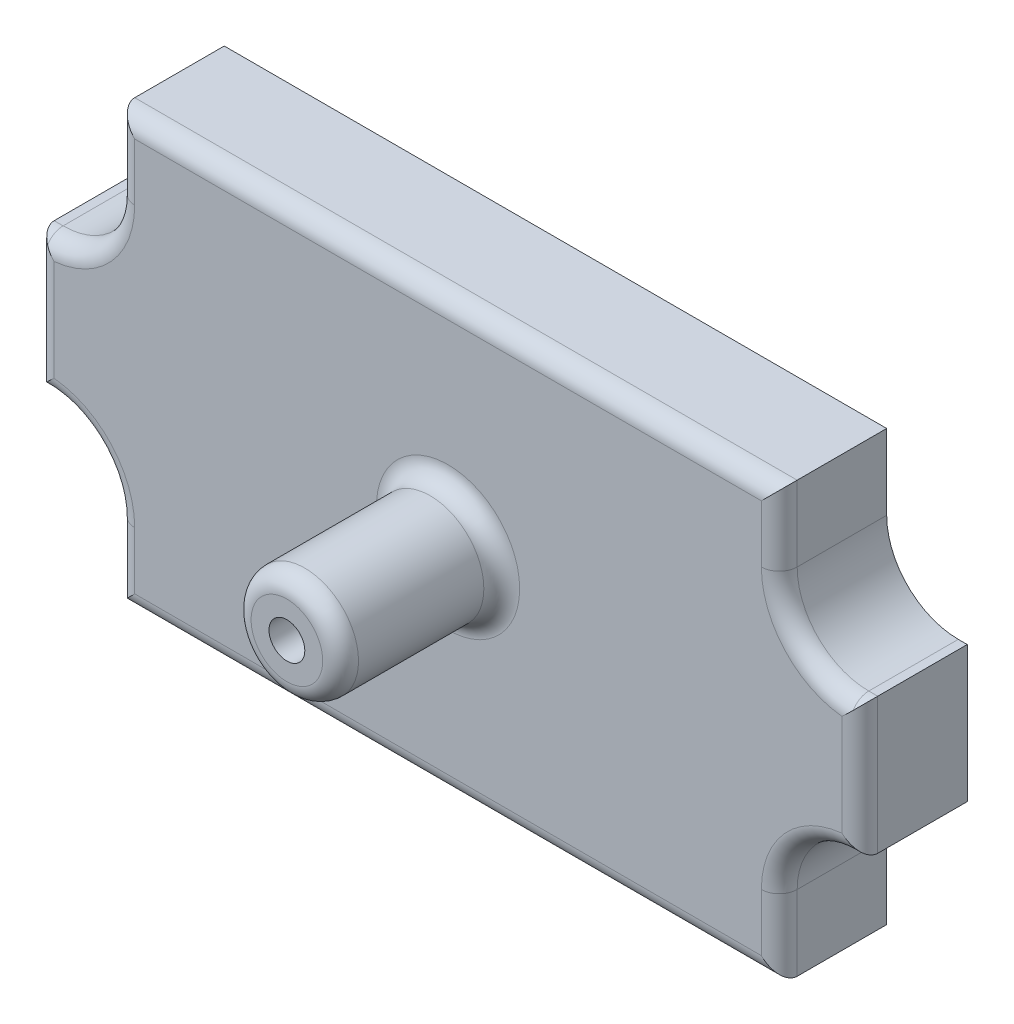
ISO-10303-21;
HEADER;
FILE_DESCRIPTION(('STEP AP214'),'2;1');
FILE_NAME('part.step','',(''),(''),'','','');
FILE_SCHEMA(('AUTOMOTIVE_DESIGN { 1 0 10303 214 1 1 1 1 }'));
ENDSEC;
DATA;
#1=APPLICATION_CONTEXT('core data for automotive mechanical design processes');
#2=APPLICATION_PROTOCOL_DEFINITION('international standard','automotive_design',2000,#1);
#3=PRODUCT_CONTEXT('',#1,'mechanical');
#4=PRODUCT('Part','Part','',(#3));
#5=PRODUCT_RELATED_PRODUCT_CATEGORY('part','',(#4));
#6=PRODUCT_DEFINITION_FORMATION('','',#4);
#7=PRODUCT_DEFINITION_CONTEXT('part definition',#1,'design');
#8=PRODUCT_DEFINITION('design','',#6,#7);
#9=PRODUCT_DEFINITION_SHAPE('','',#8);
#10=(LENGTH_UNIT() NAMED_UNIT(*) SI_UNIT(.MILLI.,.METRE.));
#11=(NAMED_UNIT(*) PLANE_ANGLE_UNIT() SI_UNIT($,.RADIAN.));
#12=(NAMED_UNIT(*) SI_UNIT($,.STERADIAN.) SOLID_ANGLE_UNIT());
#13=UNCERTAINTY_MEASURE_WITH_UNIT(LENGTH_MEASURE(1.E-05),#10,'distance_accuracy_value','');
#14=(GEOMETRIC_REPRESENTATION_CONTEXT(3) GLOBAL_UNCERTAINTY_ASSIGNED_CONTEXT((#13)) GLOBAL_UNIT_ASSIGNED_CONTEXT((#10,
#11,#12)) REPRESENTATION_CONTEXT('',''));
#15=CARTESIAN_POINT('',(0.,0.,0.));
#16=DIRECTION('',(0.,0.,1.));
#17=DIRECTION('',(1.,0.,0.));
#18=AXIS2_PLACEMENT_3D('',#15,#16,#17);
#19=CARTESIAN_POINT('',(11.25,3.9,2.));
#20=DIRECTION('',(0.,0.,-1.));
#21=DIRECTION('',(-1.,0.,0.));
#22=AXIS2_PLACEMENT_3D('',#19,#20,#21);
#23=PLANE('',#22);
#24=CARTESIAN_POINT('',(6.,0.,2.));
#25=DIRECTION('',(0.,0.,-1.));
#26=DIRECTION('',(-1.,0.,0.));
#27=AXIS2_PLACEMENT_3D('',#24,#25,#26);
#28=CIRCLE('',#27,0.6);
#29=CARTESIAN_POINT('',(5.4,0.,2.));
#30=VERTEX_POINT('',#29);
#31=EDGE_CURVE('E1191',#30,#30,#28,.T.);
#32=ORIENTED_EDGE('',*,*,#31,.F.);
#33=EDGE_LOOP('',(#32));
#34=FACE_BOUND('',#33,.T.);
#35=CARTESIAN_POINT('',(0.,0.,2.));
#36=DIRECTION('',(0.,0.,-1.));
#37=DIRECTION('',(-1.,0.,0.));
#38=AXIS2_PLACEMENT_3D('',#35,#36,#37);
#39=CIRCLE('',#38,0.5);
#40=CARTESIAN_POINT('',(-0.5,0.,2.));
#41=VERTEX_POINT('',#40);
#42=EDGE_CURVE('E37',#41,#41,#39,.T.);
#43=ORIENTED_EDGE('',*,*,#42,.F.);
#44=EDGE_LOOP('',(#43));
#45=FACE_BOUND('',#44,.T.);
#46=DIRECTION('',(1.,0.,0.));
#47=VECTOR('',#46,1.);
#48=CARTESIAN_POINT('',(-8.45,5.2,2.));
#49=LINE('',#48,#47);
#50=CARTESIAN_POINT('',(-8.45,5.2,2.));
#51=VERTEX_POINT('',#50);
#52=CARTESIAN_POINT('',(8.45,5.2,2.));
#53=VERTEX_POINT('',#52);
#54=EDGE_CURVE('E320',#51,#53,#49,.T.);
#55=ORIENTED_EDGE('',*,*,#54,.T.);
#56=DIRECTION('',(0.,-1.,0.));
#57=VECTOR('',#56,1.);
#58=CARTESIAN_POINT('',(8.45,5.2,2.));
#59=LINE('',#58,#57);
#60=CARTESIAN_POINT('',(8.45,3.90000000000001,2.));
#61=VERTEX_POINT('',#60);
#62=EDGE_CURVE('E323',#53,#61,#59,.T.);
#63=ORIENTED_EDGE('',*,*,#62,.T.);
#64=CARTESIAN_POINT('',(11.25,3.9,2.));
#65=DIRECTION('',(0.,0.,1.));
#66=DIRECTION('',(-1.,0.,0.));
#67=AXIS2_PLACEMENT_3D('',#64,#65,#66);
#68=CIRCLE('',#67,2.8);
#69=CARTESIAN_POINT('',(10.7,1.15454921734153,2.));
#70=VERTEX_POINT('',#69);
#71=EDGE_CURVE('E275',#61,#70,#68,.T.);
#72=ORIENTED_EDGE('',*,*,#71,.T.);
#73=DIRECTION('',(0.,-1.,0.));
#74=VECTOR('',#73,1.);
#75=CARTESIAN_POINT('',(10.7,1.15454921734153,2.));
#76=LINE('',#75,#74);
#77=CARTESIAN_POINT('',(10.7,-1.15454921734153,2.));
#78=VERTEX_POINT('',#77);
#79=EDGE_CURVE('E326',#70,#78,#76,.T.);
#80=ORIENTED_EDGE('',*,*,#79,.T.);
#81=CARTESIAN_POINT('',(11.25,-3.9,2.));
#82=DIRECTION('',(0.,0.,1.));
#83=DIRECTION('',(-1.,0.,0.));
#84=AXIS2_PLACEMENT_3D('',#81,#82,#83);
#85=CIRCLE('',#84,2.8);
#86=CARTESIAN_POINT('',(8.45,-3.90000000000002,2.));
#87=VERTEX_POINT('',#86);
#88=EDGE_CURVE('E329',#78,#87,#85,.T.);
#89=ORIENTED_EDGE('',*,*,#88,.T.);
#90=DIRECTION('',(0.,-1.,0.));
#91=VECTOR('',#90,1.);
#92=CARTESIAN_POINT('',(8.45,-3.90000000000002,2.));
#93=LINE('',#92,#91);
#94=CARTESIAN_POINT('',(8.45,-5.19999999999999,2.));
#95=VERTEX_POINT('',#94);
#96=EDGE_CURVE('E332',#87,#95,#93,.T.);
#97=ORIENTED_EDGE('',*,*,#96,.T.);
#98=DIRECTION('',(-1.,0.,0.));
#99=VECTOR('',#98,1.);
#100=CARTESIAN_POINT('',(8.45,-5.19999999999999,2.));
#101=LINE('',#100,#99);
#102=CARTESIAN_POINT('',(-8.45,-5.19999999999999,2.));
#103=VERTEX_POINT('',#102);
#104=EDGE_CURVE('E335',#95,#103,#101,.T.);
#105=ORIENTED_EDGE('',*,*,#104,.T.);
#106=DIRECTION('',(0.,1.,0.));
#107=VECTOR('',#106,1.);
#108=CARTESIAN_POINT('',(-8.45,-5.19999999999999,2.));
#109=LINE('',#108,#107);
#110=CARTESIAN_POINT('',(-8.45,-3.90000000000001,2.));
#111=VERTEX_POINT('',#110);
#112=EDGE_CURVE('E338',#103,#111,#109,.T.);
#113=ORIENTED_EDGE('',*,*,#112,.T.);
#114=CARTESIAN_POINT('',(-11.25,-3.9,2.));
#115=DIRECTION('',(0.,0.,1.));
#116=DIRECTION('',(-1.,0.,0.));
#117=AXIS2_PLACEMENT_3D('',#114,#115,#116);
#118=CIRCLE('',#117,2.8);
#119=CARTESIAN_POINT('',(-10.7,-1.15454921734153,2.));
#120=VERTEX_POINT('',#119);
#121=EDGE_CURVE('E341',#111,#120,#118,.T.);
#122=ORIENTED_EDGE('',*,*,#121,.T.);
#123=DIRECTION('',(0.,1.,0.));
#124=VECTOR('',#123,1.);
#125=CARTESIAN_POINT('',(-10.7,-1.15454921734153,2.));
#126=LINE('',#125,#124);
#127=CARTESIAN_POINT('',(-10.7,1.15454921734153,2.));
#128=VERTEX_POINT('',#127);
#129=EDGE_CURVE('E344',#120,#128,#126,.T.);
#130=ORIENTED_EDGE('',*,*,#129,.T.);
#131=CARTESIAN_POINT('',(-11.25,3.9,2.));
#132=DIRECTION('',(0.,0.,1.));
#133=DIRECTION('',(-1.,0.,0.));
#134=AXIS2_PLACEMENT_3D('',#131,#132,#133);
#135=CIRCLE('',#134,2.8);
#136=CARTESIAN_POINT('',(-8.45,3.90000000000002,2.));
#137=VERTEX_POINT('',#136);
#138=EDGE_CURVE('E347',#128,#137,#135,.T.);
#139=ORIENTED_EDGE('',*,*,#138,.T.);
#140=DIRECTION('',(0.,1.,0.));
#141=VECTOR('',#140,1.);
#142=CARTESIAN_POINT('',(-8.45,3.90000000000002,2.));
#143=LINE('',#142,#141);
#144=EDGE_CURVE('E350',#137,#51,#143,.T.);
#145=ORIENTED_EDGE('',*,*,#144,.T.);
#146=EDGE_LOOP('',(#55,#63,#72,#80,#89,#97,#105,#113,#122,#130,#139,#145));
#147=FACE_BOUND('',#146,.T.);
#148=CARTESIAN_POINT('',(-6.,0.,2.));
#149=DIRECTION('',(0.,0.,-1.));
#150=DIRECTION('',(-1.,0.,0.));
#151=AXIS2_PLACEMENT_3D('',#148,#149,#150);
#152=CIRCLE('',#151,0.6);
#153=CARTESIAN_POINT('',(-6.6,0.,2.));
#154=VERTEX_POINT('',#153);
#155=EDGE_CURVE('E1192',#154,#154,#152,.T.);
#156=ORIENTED_EDGE('',*,*,#155,.F.);
#157=EDGE_LOOP('',(#156));
#158=FACE_BOUND('',#157,.T.);
#159=ADVANCED_FACE('F33',(#34,#45,#147,#158),#23,.T.);
#160=CARTESIAN_POINT('',(-11.25,3.9,3.));
#161=DIRECTION('',(0.,0.,1.));
#162=DIRECTION('',(1.,0.,0.));
#163=AXIS2_PLACEMENT_3D('',#160,#161,#162);
#164=PLANE('',#163);
#165=DIRECTION('',(0.,1.,0.));
#166=VECTOR('',#165,1.);
#167=CARTESIAN_POINT('',(11.,1.9,3.));
#168=LINE('',#167,#166);
#169=CARTESIAN_POINT('',(11.,-1.41253140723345,3.));
#170=VERTEX_POINT('',#169);
#171=CARTESIAN_POINT('',(11.,1.41253140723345,3.));
#172=VERTEX_POINT('',#171);
#173=EDGE_CURVE('E698',#170,#172,#168,.T.);
#174=ORIENTED_EDGE('',*,*,#173,.T.);
#175=CARTESIAN_POINT('',(11.25,3.9,3.));
#176=DIRECTION('',(0.,0.,1.));
#177=DIRECTION('',(1.,0.,0.));
#178=AXIS2_PLACEMENT_3D('',#175,#176,#177);
#179=CIRCLE('',#178,2.5);
#180=CARTESIAN_POINT('',(8.75,3.90000000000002,3.));
#181=VERTEX_POINT('',#180);
#182=EDGE_CURVE('E700',#172,#181,#179,.F.);
#183=ORIENTED_EDGE('',*,*,#182,.T.);
#184=DIRECTION('',(0.,1.,0.));
#185=VECTOR('',#184,1.);
#186=CARTESIAN_POINT('',(8.75,6.,3.));
#187=LINE('',#186,#185);
#188=CARTESIAN_POINT('',(8.75,5.5,3.));
#189=VERTEX_POINT('',#188);
#190=EDGE_CURVE('E678',#181,#189,#187,.T.);
#191=ORIENTED_EDGE('',*,*,#190,.T.);
#192=DIRECTION('',(-1.,0.,0.));
#193=VECTOR('',#192,1.);
#194=CARTESIAN_POINT('',(-9.24999999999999,5.5,3.));
#195=LINE('',#194,#193);
#196=CARTESIAN_POINT('',(-8.74999999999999,5.5,3.));
#197=VERTEX_POINT('',#196);
#198=EDGE_CURVE('E680',#189,#197,#195,.T.);
#199=ORIENTED_EDGE('',*,*,#198,.T.);
#200=DIRECTION('',(0.,-1.,0.));
#201=VECTOR('',#200,1.);
#202=CARTESIAN_POINT('',(-8.75,3.90000000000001,3.));
#203=LINE('',#202,#201);
#204=CARTESIAN_POINT('',(-8.75,3.90000000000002,3.));
#205=VERTEX_POINT('',#204);
#206=EDGE_CURVE('E682',#197,#205,#203,.T.);
#207=ORIENTED_EDGE('',*,*,#206,.T.);
#208=CARTESIAN_POINT('',(-11.25,3.9,3.));
#209=DIRECTION('',(0.,0.,1.));
#210=DIRECTION('',(1.,0.,0.));
#211=AXIS2_PLACEMENT_3D('',#208,#209,#210);
#212=CIRCLE('',#211,2.5);
#213=CARTESIAN_POINT('',(-11.,1.41253140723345,3.));
#214=VERTEX_POINT('',#213);
#215=EDGE_CURVE('E684',#205,#214,#212,.F.);
#216=ORIENTED_EDGE('',*,*,#215,.T.);
#217=DIRECTION('',(0.,-1.,0.));
#218=VECTOR('',#217,1.);
#219=CARTESIAN_POINT('',(-11.,-1.9,3.));
#220=LINE('',#219,#218);
#221=CARTESIAN_POINT('',(-11.,-1.41253140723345,3.));
#222=VERTEX_POINT('',#221);
#223=EDGE_CURVE('E686',#214,#222,#220,.T.);
#224=ORIENTED_EDGE('',*,*,#223,.T.);
#225=CARTESIAN_POINT('',(-11.25,-3.9,3.));
#226=DIRECTION('',(0.,0.,1.));
#227=DIRECTION('',(1.,0.,0.));
#228=AXIS2_PLACEMENT_3D('',#225,#226,#227);
#229=CIRCLE('',#228,2.5);
#230=CARTESIAN_POINT('',(-8.75,-3.90000000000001,3.));
#231=VERTEX_POINT('',#230);
#232=EDGE_CURVE('E688',#222,#231,#229,.F.);
#233=ORIENTED_EDGE('',*,*,#232,.T.);
#234=DIRECTION('',(0.,-1.,0.));
#235=VECTOR('',#234,1.);
#236=CARTESIAN_POINT('',(-8.75,-5.99999999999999,3.));
#237=LINE('',#236,#235);
#238=CARTESIAN_POINT('',(-8.75,-5.49999999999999,3.));
#239=VERTEX_POINT('',#238);
#240=EDGE_CURVE('E690',#231,#239,#237,.T.);
#241=ORIENTED_EDGE('',*,*,#240,.T.);
#242=DIRECTION('',(1.,0.,0.));
#243=VECTOR('',#242,1.);
#244=CARTESIAN_POINT('',(9.25,-5.49999999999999,3.));
#245=LINE('',#244,#243);
#246=CARTESIAN_POINT('',(8.75,-5.49999999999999,3.));
#247=VERTEX_POINT('',#246);
#248=EDGE_CURVE('E692',#239,#247,#245,.T.);
#249=ORIENTED_EDGE('',*,*,#248,.T.);
#250=DIRECTION('',(0.,1.,0.));
#251=VECTOR('',#250,1.);
#252=CARTESIAN_POINT('',(8.75,-3.90000000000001,3.));
#253=LINE('',#252,#251);
#254=CARTESIAN_POINT('',(8.75,-3.90000000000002,3.));
#255=VERTEX_POINT('',#254);
#256=EDGE_CURVE('E694',#247,#255,#253,.T.);
#257=ORIENTED_EDGE('',*,*,#256,.T.);
#258=CARTESIAN_POINT('',(11.25,-3.9,3.));
#259=DIRECTION('',(0.,0.,1.));
#260=DIRECTION('',(1.,0.,0.));
#261=AXIS2_PLACEMENT_3D('',#258,#259,#260);
#262=CIRCLE('',#261,2.5);
#263=EDGE_CURVE('E696',#255,#170,#262,.F.);
#264=ORIENTED_EDGE('',*,*,#263,.T.);
#265=EDGE_LOOP('',(#174,#183,#191,#199,#207,#216,#224,#233,#241,#249,#257,#264));
#266=FACE_BOUND('',#265,.T.);
#267=CARTESIAN_POINT('',(0.,0.,3.));
#268=DIRECTION('',(0.,0.,1.));
#269=DIRECTION('',(1.,0.,0.));
#270=AXIS2_PLACEMENT_3D('',#267,#268,#269);
#271=CIRCLE('',#270,2.);
#272=CARTESIAN_POINT('',(2.,0.,3.));
#273=VERTEX_POINT('',#272);
#274=EDGE_CURVE('E675',#273,#273,#271,.F.);
#275=ORIENTED_EDGE('',*,*,#274,.T.);
#276=EDGE_LOOP('',(#275));
#277=FACE_BOUND('',#276,.T.);
#278=ADVANCED_FACE('F488',(#266,#277),#164,.T.);
#279=CARTESIAN_POINT('',(9.25,3.90000000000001,3.));
#280=DIRECTION('',(-1.,0.,0.));
#281=DIRECTION('',(0.,0.,1.));
#282=AXIS2_PLACEMENT_3D('',#279,#280,#281);
#283=PLANE('',#282);
#284=DIRECTION('',(0.,0.,-1.));
#285=VECTOR('',#284,1.);
#286=CARTESIAN_POINT('',(9.25,6.,3.));
#287=LINE('',#286,#285);
#288=CARTESIAN_POINT('',(9.25,6.,2.5));
#289=VERTEX_POINT('',#288);
#290=CARTESIAN_POINT('',(9.25,6.,0.));
#291=VERTEX_POINT('',#290);
#292=EDGE_CURVE('E673',#289,#291,#287,.T.);
#293=ORIENTED_EDGE('',*,*,#292,.F.);
#294=DIRECTION('',(0.,1.,0.));
#295=VECTOR('',#294,1.);
#296=CARTESIAN_POINT('',(9.25,3.90000000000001,2.5));
#297=LINE('',#296,#295);
#298=CARTESIAN_POINT('',(9.25,3.90000000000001,2.5));
#299=VERTEX_POINT('',#298);
#300=EDGE_CURVE('E726',#289,#299,#297,.F.);
#301=ORIENTED_EDGE('',*,*,#300,.T.);
#302=DIRECTION('',(0.,0.,-1.));
#303=VECTOR('',#302,1.);
#304=CARTESIAN_POINT('',(9.25,3.90000000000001,3.));
#305=LINE('',#304,#303);
#306=CARTESIAN_POINT('',(9.25,3.90000000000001,0.));
#307=VERTEX_POINT('',#306);
#308=EDGE_CURVE('E648',#299,#307,#305,.T.);
#309=ORIENTED_EDGE('',*,*,#308,.T.);
#310=DIRECTION('',(0.,1.,0.));
#311=VECTOR('',#310,1.);
#312=CARTESIAN_POINT('',(9.25,3.90000000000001,0.));
#313=LINE('',#312,#311);
#314=EDGE_CURVE('E827',#307,#291,#313,.T.);
#315=ORIENTED_EDGE('',*,*,#314,.T.);
#316=EDGE_LOOP('',(#293,#301,#309,#315));
#317=FACE_BOUND('',#316,.T.);
#318=ADVANCED_FACE('F35',(#317),#283,.F.);
#319=CARTESIAN_POINT('',(9.25,6.,3.));
#320=DIRECTION('',(0.,-1.,0.));
#321=DIRECTION('',(0.,0.,-1.));
#322=AXIS2_PLACEMENT_3D('',#319,#320,#321);
#323=PLANE('',#322);
#324=DIRECTION('',(0.,0.,-1.));
#325=VECTOR('',#324,1.);
#326=CARTESIAN_POINT('',(-9.24999999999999,6.,3.));
#327=LINE('',#326,#325);
#328=CARTESIAN_POINT('',(-9.24999999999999,6.,2.5));
#329=VERTEX_POINT('',#328);
#330=CARTESIAN_POINT('',(-9.24999999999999,6.,0.));
#331=VERTEX_POINT('',#330);
#332=EDGE_CURVE('E671',#329,#331,#327,.T.);
#333=ORIENTED_EDGE('',*,*,#332,.F.);
#334=DIRECTION('',(-1.,0.,0.));
#335=VECTOR('',#334,1.);
#336=CARTESIAN_POINT('',(9.25,6.,2.5));
#337=LINE('',#336,#335);
#338=EDGE_CURVE('E57',#329,#289,#337,.F.);
#339=ORIENTED_EDGE('',*,*,#338,.T.);
#340=ORIENTED_EDGE('',*,*,#292,.T.);
#341=DIRECTION('',(-1.,0.,0.));
#342=VECTOR('',#341,1.);
#343=CARTESIAN_POINT('',(9.25,6.,0.));
#344=LINE('',#343,#342);
#345=EDGE_CURVE('E830',#291,#331,#344,.T.);
#346=ORIENTED_EDGE('',*,*,#345,.T.);
#347=EDGE_LOOP('',(#333,#339,#340,#346));
#348=FACE_BOUND('',#347,.T.);
#349=ADVANCED_FACE('F545',(#348),#323,.F.);
#350=CARTESIAN_POINT('',(-9.24999999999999,6.,3.));
#351=DIRECTION('',(1.,0.,0.));
#352=DIRECTION('',(0.,1.,0.));
#353=AXIS2_PLACEMENT_3D('',#350,#351,#352);
#354=PLANE('',#353);
#355=DIRECTION('',(0.,0.,-1.));
#356=VECTOR('',#355,1.);
#357=CARTESIAN_POINT('',(-9.25,3.90000000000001,3.));
#358=LINE('',#357,#356);
#359=CARTESIAN_POINT('',(-9.25,3.90000000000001,2.5));
#360=VERTEX_POINT('',#359);
#361=CARTESIAN_POINT('',(-9.25,3.90000000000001,0.));
#362=VERTEX_POINT('',#361);
#363=EDGE_CURVE('E669',#360,#362,#358,.T.);
#364=ORIENTED_EDGE('',*,*,#363,.F.);
#365=DIRECTION('',(0.,-1.,0.));
#366=VECTOR('',#365,1.);
#367=CARTESIAN_POINT('',(-9.24999999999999,6.,2.5));
#368=LINE('',#367,#366);
#369=EDGE_CURVE('E723',#360,#329,#368,.F.);
#370=ORIENTED_EDGE('',*,*,#369,.T.);
#371=ORIENTED_EDGE('',*,*,#332,.T.);
#372=DIRECTION('',(0.,-1.,0.));
#373=VECTOR('',#372,1.);
#374=CARTESIAN_POINT('',(-9.24999999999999,6.,0.));
#375=LINE('',#374,#373);
#376=EDGE_CURVE('E831',#331,#362,#375,.T.);
#377=ORIENTED_EDGE('',*,*,#376,.T.);
#378=EDGE_LOOP('',(#364,#370,#371,#377));
#379=FACE_BOUND('',#378,.T.);
#380=ADVANCED_FACE('F542',(#379),#354,.F.);
#381=CARTESIAN_POINT('',(-11.25,3.9,3.));
#382=DIRECTION('',(0.,0.,-1.));
#383=DIRECTION('',(-1.,0.,0.));
#384=AXIS2_PLACEMENT_3D('',#381,#382,#383);
#385=CYLINDRICAL_SURFACE('',#384,2.);
#386=DIRECTION('',(0.,0.,-1.));
#387=VECTOR('',#386,1.);
#388=CARTESIAN_POINT('',(-11.25,1.9,3.));
#389=LINE('',#388,#387);
#390=CARTESIAN_POINT('',(-11.25,1.9,2.5));
#391=VERTEX_POINT('',#390);
#392=CARTESIAN_POINT('',(-11.25,1.9,0.));
#393=VERTEX_POINT('',#392);
#394=EDGE_CURVE('E667',#391,#393,#389,.T.);
#395=ORIENTED_EDGE('',*,*,#394,.F.);
#396=CARTESIAN_POINT('',(-11.25,3.9,2.5));
#397=DIRECTION('',(0.,0.,1.));
#398=DIRECTION('',(1.,0.,0.));
#399=AXIS2_PLACEMENT_3D('',#396,#397,#398);
#400=CIRCLE('',#399,2.);
#401=EDGE_CURVE('E721',#391,#360,#400,.T.);
#402=ORIENTED_EDGE('',*,*,#401,.T.);
#403=ORIENTED_EDGE('',*,*,#363,.T.);
#404=CARTESIAN_POINT('',(-11.25,3.9,0.));
#405=DIRECTION('',(0.,0.,-1.));
#406=DIRECTION('',(1.,0.,0.));
#407=AXIS2_PLACEMENT_3D('',#404,#405,#406);
#408=CIRCLE('',#407,2.);
#409=EDGE_CURVE('E836',#362,#393,#408,.T.);
#410=ORIENTED_EDGE('',*,*,#409,.T.);
#411=EDGE_LOOP('',(#395,#402,#403,#410));
#412=FACE_BOUND('',#411,.T.);
#413=ADVANCED_FACE('F538',(#412),#385,.F.);
#414=CARTESIAN_POINT('',(-11.25,1.9,3.));
#415=DIRECTION('',(0.,-1.,0.));
#416=DIRECTION('',(0.,0.,-1.));
#417=AXIS2_PLACEMENT_3D('',#414,#415,#416);
#418=PLANE('',#417);
#419=DIRECTION('',(0.,0.,-1.));
#420=VECTOR('',#419,1.);
#421=CARTESIAN_POINT('',(-11.5,1.9,3.));
#422=LINE('',#421,#420);
#423=CARTESIAN_POINT('',(-11.5,1.9,2.5));
#424=VERTEX_POINT('',#423);
#425=CARTESIAN_POINT('',(-11.5,1.9,0.));
#426=VERTEX_POINT('',#425);
#427=EDGE_CURVE('E665',#424,#426,#422,.T.);
#428=ORIENTED_EDGE('',*,*,#427,.F.);
#429=DIRECTION('',(-1.,0.,0.));
#430=VECTOR('',#429,1.);
#431=CARTESIAN_POINT('',(-9.25,1.9,2.5));
#432=LINE('',#431,#430);
#433=EDGE_CURVE('E719',#424,#391,#432,.F.);
#434=ORIENTED_EDGE('',*,*,#433,.T.);
#435=ORIENTED_EDGE('',*,*,#394,.T.);
#436=DIRECTION('',(-1.,0.,0.));
#437=VECTOR('',#436,1.);
#438=CARTESIAN_POINT('',(-11.25,1.9,0.));
#439=LINE('',#438,#437);
#440=EDGE_CURVE('E839',#393,#426,#439,.T.);
#441=ORIENTED_EDGE('',*,*,#440,.T.);
#442=EDGE_LOOP('',(#428,#434,#435,#441));
#443=FACE_BOUND('',#442,.T.);
#444=ADVANCED_FACE('F534',(#443),#418,.F.);
#445=CARTESIAN_POINT('',(-11.5,1.9,3.));
#446=DIRECTION('',(1.,0.,0.));
#447=DIRECTION('',(0.,0.,-1.));
#448=AXIS2_PLACEMENT_3D('',#445,#446,#447);
#449=PLANE('',#448);
#450=DIRECTION('',(0.,0.,-1.));
#451=VECTOR('',#450,1.);
#452=CARTESIAN_POINT('',(-11.5,-1.9,3.));
#453=LINE('',#452,#451);
#454=CARTESIAN_POINT('',(-11.5,-1.9,2.5));
#455=VERTEX_POINT('',#454);
#456=CARTESIAN_POINT('',(-11.5,-1.9,0.));
#457=VERTEX_POINT('',#456);
#458=EDGE_CURVE('E663',#455,#457,#453,.T.);
#459=ORIENTED_EDGE('',*,*,#458,.F.);
#460=DIRECTION('',(0.,-1.,0.));
#461=VECTOR('',#460,1.);
#462=CARTESIAN_POINT('',(-11.5,1.9,2.5));
#463=LINE('',#462,#461);
#464=EDGE_CURVE('E717',#455,#424,#463,.F.);
#465=ORIENTED_EDGE('',*,*,#464,.T.);
#466=ORIENTED_EDGE('',*,*,#427,.T.);
#467=DIRECTION('',(0.,-1.,0.));
#468=VECTOR('',#467,1.);
#469=CARTESIAN_POINT('',(-11.5,1.9,0.));
#470=LINE('',#469,#468);
#471=EDGE_CURVE('E842',#426,#457,#470,.T.);
#472=ORIENTED_EDGE('',*,*,#471,.T.);
#473=EDGE_LOOP('',(#459,#465,#466,#472));
#474=FACE_BOUND('',#473,.T.);
#475=ADVANCED_FACE('F530',(#474),#449,.F.);
#476=CARTESIAN_POINT('',(-11.5,-1.9,3.));
#477=DIRECTION('',(0.,1.,0.));
#478=DIRECTION('',(0.,0.,1.));
#479=AXIS2_PLACEMENT_3D('',#476,#477,#478);
#480=PLANE('',#479);
#481=DIRECTION('',(0.,0.,-1.));
#482=VECTOR('',#481,1.);
#483=CARTESIAN_POINT('',(-11.25,-1.9,3.));
#484=LINE('',#483,#482);
#485=CARTESIAN_POINT('',(-11.25,-1.9,2.5));
#486=VERTEX_POINT('',#485);
#487=CARTESIAN_POINT('',(-11.25,-1.9,0.));
#488=VERTEX_POINT('',#487);
#489=EDGE_CURVE('E661',#486,#488,#484,.T.);
#490=ORIENTED_EDGE('',*,*,#489,.F.);
#491=DIRECTION('',(1.,0.,0.));
#492=VECTOR('',#491,1.);
#493=CARTESIAN_POINT('',(-11.25,-1.9,2.5));
#494=LINE('',#493,#492);
#495=EDGE_CURVE('E715',#486,#455,#494,.F.);
#496=ORIENTED_EDGE('',*,*,#495,.T.);
#497=ORIENTED_EDGE('',*,*,#458,.T.);
#498=DIRECTION('',(1.,0.,0.));
#499=VECTOR('',#498,1.);
#500=CARTESIAN_POINT('',(-11.5,-1.9,0.));
#501=LINE('',#500,#499);
#502=EDGE_CURVE('E845',#457,#488,#501,.T.);
#503=ORIENTED_EDGE('',*,*,#502,.T.);
#504=EDGE_LOOP('',(#490,#496,#497,#503));
#505=FACE_BOUND('',#504,.T.);
#506=ADVANCED_FACE('F526',(#505),#480,.F.);
#507=CARTESIAN_POINT('',(-11.25,-3.9,3.));
#508=DIRECTION('',(0.,0.,-1.));
#509=DIRECTION('',(-1.,0.,0.));
#510=AXIS2_PLACEMENT_3D('',#507,#508,#509);
#511=CYLINDRICAL_SURFACE('',#510,2.);
#512=DIRECTION('',(0.,0.,-1.));
#513=VECTOR('',#512,1.);
#514=CARTESIAN_POINT('',(-9.25,-3.90000000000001,3.));
#515=LINE('',#514,#513);
#516=CARTESIAN_POINT('',(-9.25,-3.90000000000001,2.5));
#517=VERTEX_POINT('',#516);
#518=CARTESIAN_POINT('',(-9.25,-3.90000000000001,0.));
#519=VERTEX_POINT('',#518);
#520=EDGE_CURVE('E659',#517,#519,#515,.T.);
#521=ORIENTED_EDGE('',*,*,#520,.F.);
#522=CARTESIAN_POINT('',(-11.25,-3.9,2.5));
#523=DIRECTION('',(0.,0.,1.));
#524=DIRECTION('',(1.,0.,0.));
#525=AXIS2_PLACEMENT_3D('',#522,#523,#524);
#526=CIRCLE('',#525,2.);
#527=EDGE_CURVE('E713',#517,#486,#526,.T.);
#528=ORIENTED_EDGE('',*,*,#527,.T.);
#529=ORIENTED_EDGE('',*,*,#489,.T.);
#530=CARTESIAN_POINT('',(-11.25,-3.9,0.));
#531=DIRECTION('',(0.,0.,-1.));
#532=DIRECTION('',(1.,0.,0.));
#533=AXIS2_PLACEMENT_3D('',#530,#531,#532);
#534=CIRCLE('',#533,2.);
#535=EDGE_CURVE('E848',#488,#519,#534,.T.);
#536=ORIENTED_EDGE('',*,*,#535,.T.);
#537=EDGE_LOOP('',(#521,#528,#529,#536));
#538=FACE_BOUND('',#537,.T.);
#539=ADVANCED_FACE('F522',(#538),#511,.F.);
#540=CARTESIAN_POINT('',(-9.25,-3.90000000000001,3.));
#541=DIRECTION('',(1.,0.,0.));
#542=DIRECTION('',(0.,0.,-1.));
#543=AXIS2_PLACEMENT_3D('',#540,#541,#542);
#544=PLANE('',#543);
#545=DIRECTION('',(0.,0.,-1.));
#546=VECTOR('',#545,1.);
#547=CARTESIAN_POINT('',(-9.25,-5.99999999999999,3.));
#548=LINE('',#547,#546);
#549=CARTESIAN_POINT('',(-9.25,-5.99999999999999,2.5));
#550=VERTEX_POINT('',#549);
#551=CARTESIAN_POINT('',(-9.25,-5.99999999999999,0.));
#552=VERTEX_POINT('',#551);
#553=EDGE_CURVE('E657',#550,#552,#548,.T.);
#554=ORIENTED_EDGE('',*,*,#553,.F.);
#555=DIRECTION('',(0.,-1.,0.));
#556=VECTOR('',#555,1.);
#557=CARTESIAN_POINT('',(-9.25,-3.90000000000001,2.5));
#558=LINE('',#557,#556);
#559=EDGE_CURVE('E711',#550,#517,#558,.F.);
#560=ORIENTED_EDGE('',*,*,#559,.T.);
#561=ORIENTED_EDGE('',*,*,#520,.T.);
#562=DIRECTION('',(0.,-1.,0.));
#563=VECTOR('',#562,1.);
#564=CARTESIAN_POINT('',(-9.25,-3.90000000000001,0.));
#565=LINE('',#564,#563);
#566=EDGE_CURVE('E851',#519,#552,#565,.T.);
#567=ORIENTED_EDGE('',*,*,#566,.T.);
#568=EDGE_LOOP('',(#554,#560,#561,#567));
#569=FACE_BOUND('',#568,.T.);
#570=ADVANCED_FACE('F518',(#569),#544,.F.);
#571=CARTESIAN_POINT('',(-9.25,-5.99999999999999,3.));
#572=DIRECTION('',(0.,1.,0.));
#573=DIRECTION('',(0.,0.,1.));
#574=AXIS2_PLACEMENT_3D('',#571,#572,#573);
#575=PLANE('',#574);
#576=DIRECTION('',(0.,0.,-1.));
#577=VECTOR('',#576,1.);
#578=CARTESIAN_POINT('',(9.25,-5.99999999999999,3.));
#579=LINE('',#578,#577);
#580=CARTESIAN_POINT('',(9.25,-5.99999999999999,2.5));
#581=VERTEX_POINT('',#580);
#582=CARTESIAN_POINT('',(9.25,-5.99999999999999,0.));
#583=VERTEX_POINT('',#582);
#584=EDGE_CURVE('E655',#581,#583,#579,.T.);
#585=ORIENTED_EDGE('',*,*,#584,.F.);
#586=DIRECTION('',(1.,0.,0.));
#587=VECTOR('',#586,1.);
#588=CARTESIAN_POINT('',(-9.25,-5.99999999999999,2.5));
#589=LINE('',#588,#587);
#590=EDGE_CURVE('E709',#581,#550,#589,.F.);
#591=ORIENTED_EDGE('',*,*,#590,.T.);
#592=ORIENTED_EDGE('',*,*,#553,.T.);
#593=DIRECTION('',(1.,0.,0.));
#594=VECTOR('',#593,1.);
#595=CARTESIAN_POINT('',(-9.25,-5.99999999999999,0.));
#596=LINE('',#595,#594);
#597=EDGE_CURVE('E814',#552,#583,#596,.T.);
#598=ORIENTED_EDGE('',*,*,#597,.T.);
#599=EDGE_LOOP('',(#585,#591,#592,#598));
#600=FACE_BOUND('',#599,.T.);
#601=ADVANCED_FACE('F514',(#600),#575,.F.);
#602=CARTESIAN_POINT('',(9.25,-5.99999999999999,3.));
#603=DIRECTION('',(-1.,0.,0.));
#604=DIRECTION('',(0.,0.,1.));
#605=AXIS2_PLACEMENT_3D('',#602,#603,#604);
#606=PLANE('',#605);
#607=DIRECTION('',(0.,0.,-1.));
#608=VECTOR('',#607,1.);
#609=CARTESIAN_POINT('',(9.25,-3.90000000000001,3.));
#610=LINE('',#609,#608);
#611=CARTESIAN_POINT('',(9.25,-3.90000000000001,2.5));
#612=VERTEX_POINT('',#611);
#613=CARTESIAN_POINT('',(9.25,-3.90000000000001,0.));
#614=VERTEX_POINT('',#613);
#615=EDGE_CURVE('E653',#612,#614,#610,.T.);
#616=ORIENTED_EDGE('',*,*,#615,.F.);
#617=DIRECTION('',(0.,1.,0.));
#618=VECTOR('',#617,1.);
#619=CARTESIAN_POINT('',(9.25,-5.99999999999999,2.5));
#620=LINE('',#619,#618);
#621=EDGE_CURVE('E707',#612,#581,#620,.F.);
#622=ORIENTED_EDGE('',*,*,#621,.T.);
#623=ORIENTED_EDGE('',*,*,#584,.T.);
#624=DIRECTION('',(0.,1.,0.));
#625=VECTOR('',#624,1.);
#626=CARTESIAN_POINT('',(9.25,-5.99999999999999,0.));
#627=LINE('',#626,#625);
#628=EDGE_CURVE('E809',#583,#614,#627,.T.);
#629=ORIENTED_EDGE('',*,*,#628,.T.);
#630=EDGE_LOOP('',(#616,#622,#623,#629));
#631=FACE_BOUND('',#630,.T.);
#632=ADVANCED_FACE('F510',(#631),#606,.F.);
#633=CARTESIAN_POINT('',(11.25,-3.9,3.));
#634=DIRECTION('',(0.,0.,-1.));
#635=DIRECTION('',(-1.,0.,0.));
#636=AXIS2_PLACEMENT_3D('',#633,#634,#635);
#637=CYLINDRICAL_SURFACE('',#636,2.);
#638=DIRECTION('',(0.,0.,-1.));
#639=VECTOR('',#638,1.);
#640=CARTESIAN_POINT('',(11.25,-1.9,3.));
#641=LINE('',#640,#639);
#642=CARTESIAN_POINT('',(11.25,-1.9,2.5));
#643=VERTEX_POINT('',#642);
#644=CARTESIAN_POINT('',(11.25,-1.9,0.));
#645=VERTEX_POINT('',#644);
#646=EDGE_CURVE('E646',#643,#645,#641,.T.);
#647=ORIENTED_EDGE('',*,*,#646,.F.);
#648=CARTESIAN_POINT('',(11.25,-3.9,2.5));
#649=DIRECTION('',(0.,0.,1.));
#650=DIRECTION('',(1.,0.,0.));
#651=AXIS2_PLACEMENT_3D('',#648,#649,#650);
#652=CIRCLE('',#651,2.);
#653=EDGE_CURVE('E705',#643,#612,#652,.T.);
#654=ORIENTED_EDGE('',*,*,#653,.T.);
#655=ORIENTED_EDGE('',*,*,#615,.T.);
#656=CARTESIAN_POINT('',(11.25,-3.9,0.));
#657=DIRECTION('',(0.,0.,-1.));
#658=DIRECTION('',(1.,0.,0.));
#659=AXIS2_PLACEMENT_3D('',#656,#657,#658);
#660=CIRCLE('',#659,2.);
#661=EDGE_CURVE('E813',#614,#645,#660,.T.);
#662=ORIENTED_EDGE('',*,*,#661,.T.);
#663=EDGE_LOOP('',(#647,#654,#655,#662));
#664=FACE_BOUND('',#663,.T.);
#665=ADVANCED_FACE('F506',(#664),#637,.F.);
#666=CARTESIAN_POINT('',(11.25,-1.9,3.));
#667=DIRECTION('',(0.,1.,0.));
#668=DIRECTION('',(0.,0.,1.));
#669=AXIS2_PLACEMENT_3D('',#666,#667,#668);
#670=PLANE('',#669);
#671=DIRECTION('',(0.,0.,-1.));
#672=VECTOR('',#671,1.);
#673=CARTESIAN_POINT('',(11.5,-1.9,3.));
#674=LINE('',#673,#672);
#675=CARTESIAN_POINT('',(11.5,-1.9,2.5));
#676=VERTEX_POINT('',#675);
#677=CARTESIAN_POINT('',(11.5,-1.9,0.));
#678=VERTEX_POINT('',#677);
#679=EDGE_CURVE('E644',#676,#678,#674,.T.);
#680=ORIENTED_EDGE('',*,*,#679,.F.);
#681=DIRECTION('',(1.,0.,0.));
#682=VECTOR('',#681,1.);
#683=CARTESIAN_POINT('',(9.25,-1.9,2.5));
#684=LINE('',#683,#682);
#685=EDGE_CURVE('E632',#676,#643,#684,.F.);
#686=ORIENTED_EDGE('',*,*,#685,.T.);
#687=ORIENTED_EDGE('',*,*,#646,.T.);
#688=DIRECTION('',(1.,0.,0.));
#689=VECTOR('',#688,1.);
#690=CARTESIAN_POINT('',(11.25,-1.9,0.));
#691=LINE('',#690,#689);
#692=EDGE_CURVE('E818',#645,#678,#691,.T.);
#693=ORIENTED_EDGE('',*,*,#692,.T.);
#694=EDGE_LOOP('',(#680,#686,#687,#693));
#695=FACE_BOUND('',#694,.T.);
#696=ADVANCED_FACE('F502',(#695),#670,.F.);
#697=CARTESIAN_POINT('',(11.5,-1.9,3.));
#698=DIRECTION('',(-1.,0.,0.));
#699=DIRECTION('',(0.,0.,1.));
#700=AXIS2_PLACEMENT_3D('',#697,#698,#699);
#701=PLANE('',#700);
#702=DIRECTION('',(0.,0.,-1.));
#703=VECTOR('',#702,1.);
#704=CARTESIAN_POINT('',(11.5,1.9,3.));
#705=LINE('',#704,#703);
#706=CARTESIAN_POINT('',(11.5,1.9,2.5));
#707=VERTEX_POINT('',#706);
#708=CARTESIAN_POINT('',(11.5,1.9,0.));
#709=VERTEX_POINT('',#708);
#710=EDGE_CURVE('E636',#707,#709,#705,.T.);
#711=ORIENTED_EDGE('',*,*,#710,.F.);
#712=DIRECTION('',(0.,1.,0.));
#713=VECTOR('',#712,1.);
#714=CARTESIAN_POINT('',(11.5,-1.9,2.5));
#715=LINE('',#714,#713);
#716=EDGE_CURVE('E626',#707,#676,#715,.F.);
#717=ORIENTED_EDGE('',*,*,#716,.T.);
#718=ORIENTED_EDGE('',*,*,#679,.T.);
#719=DIRECTION('',(0.,1.,0.));
#720=VECTOR('',#719,1.);
#721=CARTESIAN_POINT('',(11.5,-1.9,0.));
#722=LINE('',#721,#720);
#723=EDGE_CURVE('E642',#678,#709,#722,.T.);
#724=ORIENTED_EDGE('',*,*,#723,.T.);
#725=EDGE_LOOP('',(#711,#717,#718,#724));
#726=FACE_BOUND('',#725,.T.);
#727=ADVANCED_FACE('F498',(#726),#701,.F.);
#728=CARTESIAN_POINT('',(11.5,1.9,3.));
#729=DIRECTION('',(0.,-1.,0.));
#730=DIRECTION('',(0.,0.,-1.));
#731=AXIS2_PLACEMENT_3D('',#728,#729,#730);
#732=PLANE('',#731);
#733=DIRECTION('',(0.,0.,-1.));
#734=VECTOR('',#733,1.);
#735=CARTESIAN_POINT('',(11.25,1.9,3.));
#736=LINE('',#735,#734);
#737=CARTESIAN_POINT('',(11.25,1.9,2.5));
#738=VERTEX_POINT('',#737);
#739=CARTESIAN_POINT('',(11.25,1.9,0.));
#740=VERTEX_POINT('',#739);
#741=EDGE_CURVE('E638',#738,#740,#736,.T.);
#742=ORIENTED_EDGE('',*,*,#741,.F.);
#743=DIRECTION('',(-1.,0.,0.));
#744=VECTOR('',#743,1.);
#745=CARTESIAN_POINT('',(11.25,1.9,2.5));
#746=LINE('',#745,#744);
#747=EDGE_CURVE('E621',#738,#707,#746,.F.);
#748=ORIENTED_EDGE('',*,*,#747,.T.);
#749=ORIENTED_EDGE('',*,*,#710,.T.);
#750=DIRECTION('',(-1.,0.,0.));
#751=VECTOR('',#750,1.);
#752=CARTESIAN_POINT('',(11.5,1.9,0.));
#753=LINE('',#752,#751);
#754=EDGE_CURVE('E824',#709,#740,#753,.T.);
#755=ORIENTED_EDGE('',*,*,#754,.T.);
#756=EDGE_LOOP('',(#742,#748,#749,#755));
#757=FACE_BOUND('',#756,.T.);
#758=ADVANCED_FACE('F494',(#757),#732,.F.);
#759=CARTESIAN_POINT('',(11.25,3.9,3.));
#760=DIRECTION('',(0.,0.,-1.));
#761=DIRECTION('',(-1.,0.,0.));
#762=AXIS2_PLACEMENT_3D('',#759,#760,#761);
#763=CYLINDRICAL_SURFACE('',#762,2.);
#764=ORIENTED_EDGE('',*,*,#308,.F.);
#765=CARTESIAN_POINT('',(11.25,3.9,2.5));
#766=DIRECTION('',(0.,0.,1.));
#767=DIRECTION('',(1.,0.,0.));
#768=AXIS2_PLACEMENT_3D('',#765,#766,#767);
#769=CIRCLE('',#768,2.);
#770=EDGE_CURVE('E639',#299,#738,#769,.T.);
#771=ORIENTED_EDGE('',*,*,#770,.T.);
#772=ORIENTED_EDGE('',*,*,#741,.T.);
#773=CARTESIAN_POINT('',(11.25,3.9,0.));
#774=DIRECTION('',(0.,0.,-1.));
#775=DIRECTION('',(1.,0.,0.));
#776=AXIS2_PLACEMENT_3D('',#773,#774,#775);
#777=CIRCLE('',#776,2.);
#778=EDGE_CURVE('E748',#740,#307,#777,.T.);
#779=ORIENTED_EDGE('',*,*,#778,.T.);
#780=EDGE_LOOP('',(#764,#771,#772,#779));
#781=FACE_BOUND('',#780,.T.);
#782=ADVANCED_FACE('F487',(#781),#763,.F.);
#783=CARTESIAN_POINT('',(-11.25,3.9,0.));
#784=DIRECTION('',(0.,0.,1.));
#785=DIRECTION('',(1.,0.,0.));
#786=AXIS2_PLACEMENT_3D('',#783,#784,#785);
#787=PLANE('',#786);
#788=DIRECTION('',(0.,-1.,0.));
#789=VECTOR('',#788,1.);
#790=CARTESIAN_POINT('',(8.45,5.2,0.));
#791=LINE('',#790,#789);
#792=CARTESIAN_POINT('',(8.45,5.2,0.));
#793=VERTEX_POINT('',#792);
#794=CARTESIAN_POINT('',(8.45,3.90000000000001,0.));
#795=VERTEX_POINT('',#794);
#796=EDGE_CURVE('E283',#793,#795,#791,.T.);
#797=ORIENTED_EDGE('',*,*,#796,.F.);
#798=DIRECTION('',(1.,0.,0.));
#799=VECTOR('',#798,1.);
#800=CARTESIAN_POINT('',(-8.45,5.2,0.));
#801=LINE('',#800,#799);
#802=CARTESIAN_POINT('',(-8.45,5.2,0.));
#803=VERTEX_POINT('',#802);
#804=EDGE_CURVE('E49',#803,#793,#801,.T.);
#805=ORIENTED_EDGE('',*,*,#804,.F.);
#806=DIRECTION('',(0.,1.,0.));
#807=VECTOR('',#806,1.);
#808=CARTESIAN_POINT('',(-8.45,3.90000000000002,0.));
#809=LINE('',#808,#807);
#810=CARTESIAN_POINT('',(-8.45,3.90000000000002,0.));
#811=VERTEX_POINT('',#810);
#812=EDGE_CURVE('E317',#811,#803,#809,.T.);
#813=ORIENTED_EDGE('',*,*,#812,.F.);
#814=CARTESIAN_POINT('',(-11.25,3.9,0.));
#815=DIRECTION('',(0.,0.,1.));
#816=DIRECTION('',(-1.,0.,0.));
#817=AXIS2_PLACEMENT_3D('',#814,#815,#816);
#818=CIRCLE('',#817,2.8);
#819=CARTESIAN_POINT('',(-10.7,1.15454921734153,0.));
#820=VERTEX_POINT('',#819);
#821=EDGE_CURVE('E314',#820,#811,#818,.T.);
#822=ORIENTED_EDGE('',*,*,#821,.F.);
#823=DIRECTION('',(0.,1.,0.));
#824=VECTOR('',#823,1.);
#825=CARTESIAN_POINT('',(-10.7,-1.15454921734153,0.));
#826=LINE('',#825,#824);
#827=CARTESIAN_POINT('',(-10.7,-1.15454921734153,0.));
#828=VERTEX_POINT('',#827);
#829=EDGE_CURVE('E311',#828,#820,#826,.T.);
#830=ORIENTED_EDGE('',*,*,#829,.F.);
#831=CARTESIAN_POINT('',(-11.25,-3.9,0.));
#832=DIRECTION('',(0.,0.,1.));
#833=DIRECTION('',(-1.,0.,0.));
#834=AXIS2_PLACEMENT_3D('',#831,#832,#833);
#835=CIRCLE('',#834,2.8);
#836=CARTESIAN_POINT('',(-8.45,-3.90000000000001,0.));
#837=VERTEX_POINT('',#836);
#838=EDGE_CURVE('E308',#837,#828,#835,.T.);
#839=ORIENTED_EDGE('',*,*,#838,.F.);
#840=DIRECTION('',(0.,1.,0.));
#841=VECTOR('',#840,1.);
#842=CARTESIAN_POINT('',(-8.45,-5.19999999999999,0.));
#843=LINE('',#842,#841);
#844=CARTESIAN_POINT('',(-8.45,-5.19999999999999,0.));
#845=VERTEX_POINT('',#844);
#846=EDGE_CURVE('E305',#845,#837,#843,.T.);
#847=ORIENTED_EDGE('',*,*,#846,.F.);
#848=DIRECTION('',(-1.,0.,0.));
#849=VECTOR('',#848,1.);
#850=CARTESIAN_POINT('',(8.45,-5.19999999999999,0.));
#851=LINE('',#850,#849);
#852=CARTESIAN_POINT('',(8.45,-5.19999999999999,0.));
#853=VERTEX_POINT('',#852);
#854=EDGE_CURVE('E302',#853,#845,#851,.T.);
#855=ORIENTED_EDGE('',*,*,#854,.F.);
#856=DIRECTION('',(0.,-1.,0.));
#857=VECTOR('',#856,1.);
#858=CARTESIAN_POINT('',(8.45,-3.90000000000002,0.));
#859=LINE('',#858,#857);
#860=CARTESIAN_POINT('',(8.45,-3.90000000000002,0.));
#861=VERTEX_POINT('',#860);
#862=EDGE_CURVE('E299',#861,#853,#859,.T.);
#863=ORIENTED_EDGE('',*,*,#862,.F.);
#864=CARTESIAN_POINT('',(11.25,-3.9,0.));
#865=DIRECTION('',(0.,0.,1.));
#866=DIRECTION('',(-1.,0.,0.));
#867=AXIS2_PLACEMENT_3D('',#864,#865,#866);
#868=CIRCLE('',#867,2.8);
#869=CARTESIAN_POINT('',(10.7,-1.15454921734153,0.));
#870=VERTEX_POINT('',#869);
#871=EDGE_CURVE('E293',#870,#861,#868,.T.);
#872=ORIENTED_EDGE('',*,*,#871,.F.);
#873=DIRECTION('',(0.,-1.,0.));
#874=VECTOR('',#873,1.);
#875=CARTESIAN_POINT('',(10.7,1.15454921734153,0.));
#876=LINE('',#875,#874);
#877=CARTESIAN_POINT('',(10.7,1.15454921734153,0.));
#878=VERTEX_POINT('',#877);
#879=EDGE_CURVE('E291',#878,#870,#876,.T.);
#880=ORIENTED_EDGE('',*,*,#879,.F.);
#881=CARTESIAN_POINT('',(11.25,3.9,0.));
#882=DIRECTION('',(0.,0.,1.));
#883=DIRECTION('',(-1.,0.,0.));
#884=AXIS2_PLACEMENT_3D('',#881,#882,#883);
#885=CIRCLE('',#884,2.8);
#886=EDGE_CURVE('E272',#795,#878,#885,.T.);
#887=ORIENTED_EDGE('',*,*,#886,.F.);
#888=EDGE_LOOP('',(#797,#805,#813,#822,#830,#839,#847,#855,#863,#872,#880,#887));
#889=FACE_BOUND('',#888,.T.);
#890=ORIENTED_EDGE('',*,*,#314,.F.);
#891=ORIENTED_EDGE('',*,*,#778,.F.);
#892=ORIENTED_EDGE('',*,*,#754,.F.);
#893=ORIENTED_EDGE('',*,*,#723,.F.);
#894=ORIENTED_EDGE('',*,*,#692,.F.);
#895=ORIENTED_EDGE('',*,*,#661,.F.);
#896=ORIENTED_EDGE('',*,*,#628,.F.);
#897=ORIENTED_EDGE('',*,*,#597,.F.);
#898=ORIENTED_EDGE('',*,*,#566,.F.);
#899=ORIENTED_EDGE('',*,*,#535,.F.);
#900=ORIENTED_EDGE('',*,*,#502,.F.);
#901=ORIENTED_EDGE('',*,*,#471,.F.);
#902=ORIENTED_EDGE('',*,*,#440,.F.);
#903=ORIENTED_EDGE('',*,*,#409,.F.);
#904=ORIENTED_EDGE('',*,*,#376,.F.);
#905=ORIENTED_EDGE('',*,*,#345,.F.);
#906=EDGE_LOOP('',(#890,#891,#892,#893,#894,#895,#896,#897,#898,#899,#900,#901,#902,#903,#904,#905));
#907=FACE_BOUND('',#906,.T.);
#908=ADVANCED_FACE('F287',(#889,#907),#787,.F.);
#909=CARTESIAN_POINT('',(0.,0.,7.5));
#910=DIRECTION('',(0.,0.,-1.));
#911=DIRECTION('',(-1.,0.,0.));
#912=AXIS2_PLACEMENT_3D('',#909,#910,#911);
#913=CYLINDRICAL_SURFACE('',#912,1.5);
#914=CARTESIAN_POINT('',(0.,0.,3.5));
#915=DIRECTION('',(0.,0.,1.));
#916=DIRECTION('',(1.,0.,0.));
#917=AXIS2_PLACEMENT_3D('',#914,#915,#916);
#918=CIRCLE('',#917,1.5);
#919=CARTESIAN_POINT('',(1.5,0.,3.5));
#920=VERTEX_POINT('',#919);
#921=EDGE_CURVE('E42',#920,#920,#918,.T.);
#922=ORIENTED_EDGE('',*,*,#921,.T.);
#923=EDGE_LOOP('',(#922));
#924=FACE_BOUND('',#923,.T.);
#925=CARTESIAN_POINT('',(0.,0.,7.));
#926=DIRECTION('',(0.,0.,1.));
#927=DIRECTION('',(1.,0.,0.));
#928=AXIS2_PLACEMENT_3D('',#925,#926,#927);
#929=CIRCLE('',#928,1.5);
#930=CARTESIAN_POINT('',(1.5,0.,7.));
#931=VERTEX_POINT('',#930);
#932=EDGE_CURVE('E728',#931,#931,#929,.F.);
#933=ORIENTED_EDGE('',*,*,#932,.T.);
#934=EDGE_LOOP('',(#933));
#935=FACE_BOUND('',#934,.T.);
#936=ADVANCED_FACE('F480',(#924,#935),#913,.T.);
#937=CARTESIAN_POINT('',(0.,0.,7.5));
#938=DIRECTION('',(0.,0.,1.));
#939=DIRECTION('',(1.,0.,0.));
#940=AXIS2_PLACEMENT_3D('',#937,#938,#939);
#941=PLANE('',#940);
#942=CARTESIAN_POINT('',(0.,0.,7.5));
#943=DIRECTION('',(0.,0.,1.));
#944=DIRECTION('',(1.,0.,0.));
#945=AXIS2_PLACEMENT_3D('',#942,#943,#944);
#946=CIRCLE('',#945,0.5);
#947=CARTESIAN_POINT('',(0.5,0.,7.5));
#948=VERTEX_POINT('',#947);
#949=EDGE_CURVE('E1202',#948,#948,#946,.T.);
#950=ORIENTED_EDGE('',*,*,#949,.F.);
#951=EDGE_LOOP('',(#950));
#952=FACE_BOUND('',#951,.T.);
#953=CARTESIAN_POINT('',(0.,0.,7.5));
#954=DIRECTION('',(0.,0.,1.));
#955=DIRECTION('',(1.,0.,0.));
#956=AXIS2_PLACEMENT_3D('',#953,#954,#955);
#957=CIRCLE('',#956,1.);
#958=CARTESIAN_POINT('',(1.,0.,7.5));
#959=VERTEX_POINT('',#958);
#960=EDGE_CURVE('E11',#959,#959,#957,.T.);
#961=ORIENTED_EDGE('',*,*,#960,.T.);
#962=EDGE_LOOP('',(#961));
#963=FACE_BOUND('',#962,.T.);
#964=ADVANCED_FACE('F476',(#952,#963),#941,.T.);
#965=CARTESIAN_POINT('',(-11.25,-1.4,2.5));
#966=DIRECTION('',(-1.,0.,0.));
#967=DIRECTION('',(0.,0.,1.));
#968=AXIS2_PLACEMENT_3D('',#965,#966,#967);
#969=CYLINDRICAL_SURFACE('',#968,0.5);
#970=CARTESIAN_POINT('',(-11.,-1.4,2.5));
#971=DIRECTION('',(-0.707106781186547,0.707106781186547,0.));
#972=DIRECTION('',(0.707106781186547,0.707106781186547,0.));
#973=AXIS2_PLACEMENT_3D('',#970,#971,#972);
#974=ELLIPSE('',#973,0.707106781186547,0.5);
#975=CARTESIAN_POINT('',(-11.25,-1.65000000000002,2.93301270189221));
#976=VERTEX_POINT('',#975);
#977=EDGE_CURVE('E454',#455,#976,#974,.T.);
#978=ORIENTED_EDGE('',*,*,#977,.F.);
#979=ORIENTED_EDGE('',*,*,#495,.F.);
#980=CARTESIAN_POINT('',(-11.25,-1.4,2.5));
#981=DIRECTION('',(1.,0.,0.));
#982=DIRECTION('',(0.,0.,-1.));
#983=AXIS2_PLACEMENT_3D('',#980,#981,#982);
#984=CIRCLE('',#983,0.5);
#985=EDGE_CURVE('E464',#976,#486,#984,.T.);
#986=ORIENTED_EDGE('',*,*,#985,.F.);
#987=EDGE_LOOP('',(#978,#979,#986));
#988=FACE_BOUND('',#987,.T.);
#989=ADVANCED_FACE('F471',(#988),#969,.T.);
#990=CARTESIAN_POINT('',(-11.25,-3.9,2.5));
#991=DIRECTION('',(0.,0.,1.));
#992=DIRECTION('',(1.,0.,0.));
#993=AXIS2_PLACEMENT_3D('',#990,#991,#992);
#994=TOROIDAL_SURFACE('',#993,2.5,0.5);
#995=CARTESIAN_POINT('',(-8.75,-3.90000000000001,2.5));
#996=DIRECTION('',(0.,-1.,0.));
#997=DIRECTION('',(0.,0.,-1.));
#998=AXIS2_PLACEMENT_3D('',#995,#996,#997);
#999=CIRCLE('',#998,0.5);
#1000=EDGE_CURVE('E447',#231,#517,#999,.T.);
#1001=ORIENTED_EDGE('',*,*,#1000,.F.);
#1002=ORIENTED_EDGE('',*,*,#232,.F.);
#1003=CARTESIAN_POINT('',(-11.25,-1.65000000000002,2.93301270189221));
#1004=CARTESIAN_POINT('',(-11.2223049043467,-1.62228880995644,2.94895958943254));
#1005=CARTESIAN_POINT('',(-11.1935423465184,-1.59405349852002,2.96207079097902));
#1006=CARTESIAN_POINT('',(-11.1345472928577,-1.53720005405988,2.982575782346));
#1007=CARTESIAN_POINT('',(-11.1043187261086,-1.50858307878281,2.98998404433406));
#1008=CARTESIAN_POINT('',(-11.0504090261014,-1.45845758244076,2.99800296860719));
#1009=CARTESIAN_POINT('',(-11.0269320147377,-1.43692001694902,2.99983196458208));
#1010=CARTESIAN_POINT('',(-11.0022163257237,-1.41453675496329,2.99999631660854));
#1011=CARTESIAN_POINT('',(-11.0011082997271,-1.41353390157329,3.00000000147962));
#1012=CARTESIAN_POINT('',(-11.,-1.41253140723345,3.));
#1013=B_SPLINE_CURVE_WITH_KNOTS('',3,(#1003,#1004,#1005,#1006,#1007,#1008,#1009,#1010,#1011,
#1012),.UNSPECIFIED.,.F.,.F.,(4,2,2,2,4),(0.,0.126751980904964,0.253181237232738,
0.348730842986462,0.353214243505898),.UNSPECIFIED.);
#1014=EDGE_CURVE('E457',#976,#222,#1013,.T.);
#1015=ORIENTED_EDGE('',*,*,#1014,.F.);
#1016=ORIENTED_EDGE('',*,*,#985,.T.);
#1017=ORIENTED_EDGE('',*,*,#527,.F.);
#1018=EDGE_LOOP('',(#1001,#1002,#1015,#1016,#1017));
#1019=FACE_BOUND('',#1018,.T.);
#1020=ADVANCED_FACE('F466',(#1019),#994,.T.);
#1021=CARTESIAN_POINT('',(-11.,3.9,2.5));
#1022=DIRECTION('',(0.,1.,0.));
#1023=DIRECTION('',(0.,0.,1.));
#1024=AXIS2_PLACEMENT_3D('',#1021,#1022,#1023);
#1025=CYLINDRICAL_SURFACE('',#1024,0.5);
#1026=CARTESIAN_POINT('',(-11.,1.4,2.5));
#1027=DIRECTION('',(0.707106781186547,0.707106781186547,0.));
#1028=DIRECTION('',(0.707106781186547,-0.707106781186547,0.));
#1029=AXIS2_PLACEMENT_3D('',#1026,#1027,#1028);
#1030=ELLIPSE('',#1029,0.707106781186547,0.5);
#1031=CARTESIAN_POINT('',(-11.25,1.65000000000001,2.93301270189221));
#1032=VERTEX_POINT('',#1031);
#1033=EDGE_CURVE('E452',#424,#1032,#1030,.T.);
#1034=ORIENTED_EDGE('',*,*,#1033,.F.);
#1035=ORIENTED_EDGE('',*,*,#464,.F.);
#1036=ORIENTED_EDGE('',*,*,#977,.T.);
#1037=ORIENTED_EDGE('',*,*,#1014,.T.);
#1038=ORIENTED_EDGE('',*,*,#223,.F.);
#1039=CARTESIAN_POINT('',(-11.25,1.65000000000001,2.93301270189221));
#1040=CARTESIAN_POINT('',(-11.2223049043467,1.62228880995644,2.94895958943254));
#1041=CARTESIAN_POINT('',(-11.1935423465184,1.59405349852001,2.96207079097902));
#1042=CARTESIAN_POINT('',(-11.1345472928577,1.53720005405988,2.982575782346));
#1043=CARTESIAN_POINT('',(-11.1043187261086,1.5085830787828,2.98998404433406));
#1044=CARTESIAN_POINT('',(-11.0504090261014,1.45845758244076,2.99800296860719));
#1045=CARTESIAN_POINT('',(-11.0269320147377,1.43692001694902,2.99983196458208));
#1046=CARTESIAN_POINT('',(-11.0022163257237,1.41453675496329,2.99999631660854));
#1047=CARTESIAN_POINT('',(-11.0011082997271,1.41353390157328,3.00000000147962));
#1048=CARTESIAN_POINT('',(-11.,1.41253140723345,3.));
#1049=B_SPLINE_CURVE_WITH_KNOTS('',3,(#1039,#1040,#1041,#1042,#1043,#1044,#1045,#1046,#1047,
#1048),.UNSPECIFIED.,.F.,.F.,(4,2,2,2,4),(0.,0.126751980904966,0.253181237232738,
0.34873084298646,0.353214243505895),.UNSPECIFIED.);
#1050=EDGE_CURVE('E440',#1032,#214,#1049,.T.);
#1051=ORIENTED_EDGE('',*,*,#1050,.F.);
#1052=EDGE_LOOP('',(#1034,#1035,#1036,#1037,#1038,#1051));
#1053=FACE_BOUND('',#1052,.T.);
#1054=ADVANCED_FACE('F436',(#1053),#1025,.T.);
#1055=CARTESIAN_POINT('',(-11.25,1.4,2.5));
#1056=DIRECTION('',(1.,0.,0.));
#1057=DIRECTION('',(0.,0.,-1.));
#1058=AXIS2_PLACEMENT_3D('',#1055,#1056,#1057);
#1059=CYLINDRICAL_SURFACE('',#1058,0.5);
#1060=ORIENTED_EDGE('',*,*,#433,.F.);
#1061=ORIENTED_EDGE('',*,*,#1033,.T.);
#1062=CARTESIAN_POINT('',(-11.25,1.4,2.5));
#1063=DIRECTION('',(1.,0.,0.));
#1064=DIRECTION('',(0.,0.,-1.));
#1065=AXIS2_PLACEMENT_3D('',#1062,#1063,#1064);
#1066=CIRCLE('',#1065,0.5);
#1067=EDGE_CURVE('E448',#391,#1032,#1066,.T.);
#1068=ORIENTED_EDGE('',*,*,#1067,.F.);
#1069=EDGE_LOOP('',(#1060,#1061,#1068));
#1070=FACE_BOUND('',#1069,.T.);
#1071=ADVANCED_FACE('F473',(#1070),#1059,.T.);
#1072=CARTESIAN_POINT('',(-8.75,3.9,2.5));
#1073=DIRECTION('',(0.,1.,0.));
#1074=DIRECTION('',(0.,0.,1.));
#1075=AXIS2_PLACEMENT_3D('',#1072,#1073,#1074);
#1076=CYLINDRICAL_SURFACE('',#1075,0.5);
#1077=ORIENTED_EDGE('',*,*,#1000,.T.);
#1078=ORIENTED_EDGE('',*,*,#559,.F.);
#1079=CARTESIAN_POINT('',(-8.75,-5.49999999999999,2.5));
#1080=DIRECTION('',(-0.707106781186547,0.707106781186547,0.));
#1081=DIRECTION('',(0.707106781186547,0.707106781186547,0.));
#1082=AXIS2_PLACEMENT_3D('',#1079,#1080,#1081);
#1083=ELLIPSE('',#1082,0.707106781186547,0.5);
#1084=EDGE_CURVE('E776',#239,#550,#1083,.F.);
#1085=ORIENTED_EDGE('',*,*,#1084,.F.);
#1086=ORIENTED_EDGE('',*,*,#240,.F.);
#1087=EDGE_LOOP('',(#1077,#1078,#1085,#1086));
#1088=FACE_BOUND('',#1087,.T.);
#1089=ADVANCED_FACE('F434',(#1088),#1076,.T.);
#1090=CARTESIAN_POINT('',(-11.25,3.9,2.5));
#1091=DIRECTION('',(0.,0.,1.));
#1092=DIRECTION('',(1.,0.,0.));
#1093=AXIS2_PLACEMENT_3D('',#1090,#1091,#1092);
#1094=TOROIDAL_SURFACE('',#1093,2.5,0.5);
#1095=ORIENTED_EDGE('',*,*,#1050,.T.);
#1096=ORIENTED_EDGE('',*,*,#215,.F.);
#1097=CARTESIAN_POINT('',(-8.75,3.90000000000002,2.5));
#1098=DIRECTION('',(0.,1.,0.));
#1099=DIRECTION('',(-1.,0.,0.));
#1100=AXIS2_PLACEMENT_3D('',#1097,#1098,#1099);
#1101=CIRCLE('',#1100,0.5);
#1102=EDGE_CURVE('E774',#360,#205,#1101,.T.);
#1103=ORIENTED_EDGE('',*,*,#1102,.F.);
#1104=ORIENTED_EDGE('',*,*,#401,.F.);
#1105=ORIENTED_EDGE('',*,*,#1067,.T.);
#1106=EDGE_LOOP('',(#1095,#1096,#1103,#1104,#1105));
#1107=FACE_BOUND('',#1106,.T.);
#1108=ADVANCED_FACE('F429',(#1107),#1094,.T.);
#1109=CARTESIAN_POINT('',(-11.25,-5.49999999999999,2.5));
#1110=DIRECTION('',(-1.,0.,0.));
#1111=DIRECTION('',(0.,0.,1.));
#1112=AXIS2_PLACEMENT_3D('',#1109,#1110,#1111);
#1113=CYLINDRICAL_SURFACE('',#1112,0.5);
#1114=ORIENTED_EDGE('',*,*,#1084,.T.);
#1115=ORIENTED_EDGE('',*,*,#590,.F.);
#1116=CARTESIAN_POINT('',(8.75,-5.49999999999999,2.5));
#1117=DIRECTION('',(-0.707106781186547,-0.707106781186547,0.));
#1118=DIRECTION('',(-0.707106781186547,0.707106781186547,0.));
#1119=AXIS2_PLACEMENT_3D('',#1116,#1117,#1118);
#1120=ELLIPSE('',#1119,0.707106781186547,0.5);
#1121=EDGE_CURVE('E771',#247,#581,#1120,.F.);
#1122=ORIENTED_EDGE('',*,*,#1121,.F.);
#1123=ORIENTED_EDGE('',*,*,#248,.F.);
#1124=EDGE_LOOP('',(#1114,#1115,#1122,#1123));
#1125=FACE_BOUND('',#1124,.T.);
#1126=ADVANCED_FACE('F425',(#1125),#1113,.T.);
#1127=CARTESIAN_POINT('',(-8.75,3.89999999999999,2.5));
#1128=DIRECTION('',(0.,1.,0.));
#1129=DIRECTION('',(-1.,0.,0.));
#1130=AXIS2_PLACEMENT_3D('',#1127,#1128,#1129);
#1131=CYLINDRICAL_SURFACE('',#1130,0.5);
#1132=ORIENTED_EDGE('',*,*,#1102,.T.);
#1133=ORIENTED_EDGE('',*,*,#206,.F.);
#1134=CARTESIAN_POINT('',(-8.74999999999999,5.5,2.5));
#1135=DIRECTION('',(0.707106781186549,0.707106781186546,0.));
#1136=DIRECTION('',(0.707106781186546,-0.707106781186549,0.));
#1137=AXIS2_PLACEMENT_3D('',#1134,#1135,#1136);
#1138=ELLIPSE('',#1137,0.707106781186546,0.5);
#1139=EDGE_CURVE('E768',#329,#197,#1138,.T.);
#1140=ORIENTED_EDGE('',*,*,#1139,.F.);
#1141=ORIENTED_EDGE('',*,*,#369,.F.);
#1142=EDGE_LOOP('',(#1132,#1133,#1140,#1141));
#1143=FACE_BOUND('',#1142,.T.);
#1144=ADVANCED_FACE('F421',(#1143),#1131,.T.);
#1145=CARTESIAN_POINT('',(8.75,3.9,2.5));
#1146=DIRECTION('',(0.,-1.,0.));
#1147=DIRECTION('',(0.,0.,-1.));
#1148=AXIS2_PLACEMENT_3D('',#1145,#1146,#1147);
#1149=CYLINDRICAL_SURFACE('',#1148,0.5);
#1150=ORIENTED_EDGE('',*,*,#1121,.T.);
#1151=ORIENTED_EDGE('',*,*,#621,.F.);
#1152=CARTESIAN_POINT('',(8.75,-3.90000000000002,2.5));
#1153=DIRECTION('',(0.,1.,0.));
#1154=DIRECTION('',(-1.,0.,0.));
#1155=AXIS2_PLACEMENT_3D('',#1152,#1153,#1154);
#1156=CIRCLE('',#1155,0.5);
#1157=EDGE_CURVE('E763',#255,#612,#1156,.T.);
#1158=ORIENTED_EDGE('',*,*,#1157,.F.);
#1159=ORIENTED_EDGE('',*,*,#256,.F.);
#1160=EDGE_LOOP('',(#1150,#1151,#1158,#1159));
#1161=FACE_BOUND('',#1160,.T.);
#1162=ADVANCED_FACE('F417',(#1161),#1149,.T.);
#1163=CARTESIAN_POINT('',(-11.25,5.5,2.5));
#1164=DIRECTION('',(1.,0.,0.));
#1165=DIRECTION('',(0.,0.,-1.));
#1166=AXIS2_PLACEMENT_3D('',#1163,#1164,#1165);
#1167=CYLINDRICAL_SURFACE('',#1166,0.5);
#1168=ORIENTED_EDGE('',*,*,#1139,.T.);
#1169=ORIENTED_EDGE('',*,*,#198,.F.);
#1170=CARTESIAN_POINT('',(8.75,5.5,2.5));
#1171=DIRECTION('',(0.707106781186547,-0.707106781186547,0.));
#1172=DIRECTION('',(-0.707106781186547,-0.707106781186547,0.));
#1173=AXIS2_PLACEMENT_3D('',#1170,#1171,#1172);
#1174=ELLIPSE('',#1173,0.707106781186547,0.5);
#1175=EDGE_CURVE('E762',#289,#189,#1174,.T.);
#1176=ORIENTED_EDGE('',*,*,#1175,.F.);
#1177=ORIENTED_EDGE('',*,*,#338,.F.);
#1178=EDGE_LOOP('',(#1168,#1169,#1176,#1177));
#1179=FACE_BOUND('',#1178,.T.);
#1180=ADVANCED_FACE('F413',(#1179),#1167,.T.);
#1181=CARTESIAN_POINT('',(-11.25,-1.4,2.5));
#1182=DIRECTION('',(-1.,0.,0.));
#1183=DIRECTION('',(0.,0.,1.));
#1184=AXIS2_PLACEMENT_3D('',#1181,#1182,#1183);
#1185=CYLINDRICAL_SURFACE('',#1184,0.5);
#1186=CARTESIAN_POINT('',(11.25,-1.4,2.5));
#1187=DIRECTION('',(-1.,0.,0.));
#1188=DIRECTION('',(0.,0.,1.));
#1189=AXIS2_PLACEMENT_3D('',#1186,#1187,#1188);
#1190=CIRCLE('',#1189,0.5);
#1191=CARTESIAN_POINT('',(11.25,-1.65000000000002,2.93301270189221));
#1192=VERTEX_POINT('',#1191);
#1193=EDGE_CURVE('E761',#643,#1192,#1190,.T.);
#1194=ORIENTED_EDGE('',*,*,#1193,.F.);
#1195=ORIENTED_EDGE('',*,*,#685,.F.);
#1196=CARTESIAN_POINT('',(11.,-1.4,2.5));
#1197=DIRECTION('',(-0.707106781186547,-0.707106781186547,0.));
#1198=DIRECTION('',(-0.707106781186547,0.707106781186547,0.));
#1199=AXIS2_PLACEMENT_3D('',#1196,#1197,#1198);
#1200=ELLIPSE('',#1199,0.707106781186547,0.5);
#1201=EDGE_CURVE('E629',#1192,#676,#1200,.F.);
#1202=ORIENTED_EDGE('',*,*,#1201,.F.);
#1203=EDGE_LOOP('',(#1194,#1195,#1202));
#1204=FACE_BOUND('',#1203,.T.);
#1205=ADVANCED_FACE('F406',(#1204),#1185,.T.);
#1206=CARTESIAN_POINT('',(11.25,-3.9,2.5));
#1207=DIRECTION('',(0.,0.,1.));
#1208=DIRECTION('',(1.,0.,0.));
#1209=AXIS2_PLACEMENT_3D('',#1206,#1207,#1208);
#1210=TOROIDAL_SURFACE('',#1209,2.5,0.5);
#1211=ORIENTED_EDGE('',*,*,#653,.F.);
#1212=ORIENTED_EDGE('',*,*,#1193,.T.);
#1213=CARTESIAN_POINT('',(11.25,-1.65000000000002,2.93301270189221));
#1214=CARTESIAN_POINT('',(11.2223049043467,-1.62228880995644,2.94895958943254));
#1215=CARTESIAN_POINT('',(11.1935423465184,-1.59405349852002,2.96207079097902));
#1216=CARTESIAN_POINT('',(11.1345472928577,-1.53720005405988,2.982575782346));
#1217=CARTESIAN_POINT('',(11.1043187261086,-1.50858307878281,2.98998404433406));
#1218=CARTESIAN_POINT('',(11.0504090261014,-1.45845758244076,2.99800296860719));
#1219=CARTESIAN_POINT('',(11.0269320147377,-1.43692001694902,2.99983196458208));
#1220=CARTESIAN_POINT('',(11.0022163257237,-1.41453675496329,2.99999631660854));
#1221=CARTESIAN_POINT('',(11.0011082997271,-1.41353390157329,3.00000000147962));
#1222=CARTESIAN_POINT('',(11.,-1.41253140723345,3.));
#1223=B_SPLINE_CURVE_WITH_KNOTS('',3,(#1213,#1214,#1215,#1216,#1217,#1218,#1219,#1220,#1221,
#1222),.UNSPECIFIED.,.F.,.F.,(4,2,2,2,4),(0.,0.126751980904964,0.253181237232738,
0.348730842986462,0.353214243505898),.UNSPECIFIED.);
#1224=EDGE_CURVE('E387',#170,#1192,#1223,.F.);
#1225=ORIENTED_EDGE('',*,*,#1224,.F.);
#1226=ORIENTED_EDGE('',*,*,#263,.F.);
#1227=ORIENTED_EDGE('',*,*,#1157,.T.);
#1228=EDGE_LOOP('',(#1211,#1212,#1225,#1226,#1227));
#1229=FACE_BOUND('',#1228,.T.);
#1230=ADVANCED_FACE('F401',(#1229),#1210,.T.);
#1231=CARTESIAN_POINT('',(8.75,3.9,2.5));
#1232=DIRECTION('',(0.,-1.,0.));
#1233=DIRECTION('',(0.,0.,-1.));
#1234=AXIS2_PLACEMENT_3D('',#1231,#1232,#1233);
#1235=CYLINDRICAL_SURFACE('',#1234,0.5);
#1236=ORIENTED_EDGE('',*,*,#1175,.T.);
#1237=ORIENTED_EDGE('',*,*,#190,.F.);
#1238=CARTESIAN_POINT('',(8.75,3.90000000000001,2.5));
#1239=DIRECTION('',(0.,-1.,0.));
#1240=DIRECTION('',(0.,0.,-1.));
#1241=AXIS2_PLACEMENT_3D('',#1238,#1239,#1240);
#1242=CIRCLE('',#1241,0.5);
#1243=EDGE_CURVE('E378',#299,#181,#1242,.T.);
#1244=ORIENTED_EDGE('',*,*,#1243,.F.);
#1245=ORIENTED_EDGE('',*,*,#300,.F.);
#1246=EDGE_LOOP('',(#1236,#1237,#1244,#1245));
#1247=FACE_BOUND('',#1246,.T.);
#1248=ADVANCED_FACE('F405',(#1247),#1235,.T.);
#1249=CARTESIAN_POINT('',(11.,3.9,2.5));
#1250=DIRECTION('',(0.,-1.,0.));
#1251=DIRECTION('',(0.,0.,-1.));
#1252=AXIS2_PLACEMENT_3D('',#1249,#1250,#1251);
#1253=CYLINDRICAL_SURFACE('',#1252,0.5);
#1254=CARTESIAN_POINT('',(11.25,1.65000000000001,2.93301270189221));
#1255=CARTESIAN_POINT('',(11.2223049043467,1.62228880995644,2.94895958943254));
#1256=CARTESIAN_POINT('',(11.1935423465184,1.59405349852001,2.96207079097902));
#1257=CARTESIAN_POINT('',(11.1345472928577,1.53720005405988,2.982575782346));
#1258=CARTESIAN_POINT('',(11.1043187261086,1.5085830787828,2.98998404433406));
#1259=CARTESIAN_POINT('',(11.0504090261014,1.45845758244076,2.99800296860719));
#1260=CARTESIAN_POINT('',(11.0269320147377,1.43692001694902,2.99983196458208));
#1261=CARTESIAN_POINT('',(11.0022163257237,1.41453675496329,2.99999631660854));
#1262=CARTESIAN_POINT('',(11.0011082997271,1.41353390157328,3.00000000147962));
#1263=CARTESIAN_POINT('',(11.,1.41253140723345,3.));
#1264=B_SPLINE_CURVE_WITH_KNOTS('',3,(#1254,#1255,#1256,#1257,#1258,#1259,#1260,#1261,#1262,
#1263),.UNSPECIFIED.,.F.,.F.,(4,2,2,2,4),(0.,0.126751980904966,0.253181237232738,
0.34873084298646,0.353214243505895),.UNSPECIFIED.);
#1265=CARTESIAN_POINT('',(11.25,1.65000000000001,2.93301270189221));
#1266=VERTEX_POINT('',#1265);
#1267=EDGE_CURVE('E380',#172,#1266,#1264,.F.);
#1268=ORIENTED_EDGE('',*,*,#1267,.F.);
#1269=ORIENTED_EDGE('',*,*,#173,.F.);
#1270=ORIENTED_EDGE('',*,*,#1224,.T.);
#1271=ORIENTED_EDGE('',*,*,#1201,.T.);
#1272=ORIENTED_EDGE('',*,*,#716,.F.);
#1273=CARTESIAN_POINT('',(11.,1.4,2.5));
#1274=DIRECTION('',(0.707106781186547,-0.707106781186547,0.));
#1275=DIRECTION('',(-0.707106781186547,-0.707106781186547,0.));
#1276=AXIS2_PLACEMENT_3D('',#1273,#1274,#1275);
#1277=ELLIPSE('',#1276,0.707106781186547,0.5);
#1278=EDGE_CURVE('E376',#1266,#707,#1277,.F.);
#1279=ORIENTED_EDGE('',*,*,#1278,.F.);
#1280=EDGE_LOOP('',(#1268,#1269,#1270,#1271,#1272,#1279));
#1281=FACE_BOUND('',#1280,.T.);
#1282=ADVANCED_FACE('F393',(#1281),#1253,.T.);
#1283=CARTESIAN_POINT('',(11.25,3.9,2.5));
#1284=DIRECTION('',(0.,0.,1.));
#1285=DIRECTION('',(1.,0.,0.));
#1286=AXIS2_PLACEMENT_3D('',#1283,#1284,#1285);
#1287=TOROIDAL_SURFACE('',#1286,2.5,0.5);
#1288=ORIENTED_EDGE('',*,*,#182,.F.);
#1289=ORIENTED_EDGE('',*,*,#1267,.T.);
#1290=CARTESIAN_POINT('',(11.25,1.4,2.5));
#1291=DIRECTION('',(1.,0.,0.));
#1292=DIRECTION('',(0.,1.,0.));
#1293=AXIS2_PLACEMENT_3D('',#1290,#1291,#1292);
#1294=CIRCLE('',#1293,0.5);
#1295=EDGE_CURVE('E355',#738,#1266,#1294,.T.);
#1296=ORIENTED_EDGE('',*,*,#1295,.F.);
#1297=ORIENTED_EDGE('',*,*,#770,.F.);
#1298=ORIENTED_EDGE('',*,*,#1243,.T.);
#1299=EDGE_LOOP('',(#1288,#1289,#1296,#1297,#1298));
#1300=FACE_BOUND('',#1299,.T.);
#1301=ADVANCED_FACE('F396',(#1300),#1287,.T.);
#1302=CARTESIAN_POINT('',(-11.25,1.4,2.5));
#1303=DIRECTION('',(1.,0.,0.));
#1304=DIRECTION('',(0.,0.,-1.));
#1305=AXIS2_PLACEMENT_3D('',#1302,#1303,#1304);
#1306=CYLINDRICAL_SURFACE('',#1305,0.5);
#1307=ORIENTED_EDGE('',*,*,#1278,.T.);
#1308=ORIENTED_EDGE('',*,*,#747,.F.);
#1309=ORIENTED_EDGE('',*,*,#1295,.T.);
#1310=EDGE_LOOP('',(#1307,#1308,#1309));
#1311=FACE_BOUND('',#1310,.T.);
#1312=ADVANCED_FACE('F399',(#1311),#1306,.T.);
#1313=CARTESIAN_POINT('',(0.,0.,3.5));
#1314=DIRECTION('',(0.,0.,1.));
#1315=DIRECTION('',(1.,0.,0.));
#1316=AXIS2_PLACEMENT_3D('',#1313,#1314,#1315);
#1317=TOROIDAL_SURFACE('',#1316,2.,0.5);
#1318=ORIENTED_EDGE('',*,*,#274,.F.);
#1319=EDGE_LOOP('',(#1318));
#1320=FACE_BOUND('',#1319,.T.);
#1321=ORIENTED_EDGE('',*,*,#921,.F.);
#1322=EDGE_LOOP('',(#1321));
#1323=FACE_BOUND('',#1322,.T.);
#1324=ADVANCED_FACE('F609',(#1320,#1323),#1317,.F.);
#1325=CARTESIAN_POINT('',(0.,0.,7.));
#1326=DIRECTION('',(0.,0.,1.));
#1327=DIRECTION('',(1.,0.,0.));
#1328=AXIS2_PLACEMENT_3D('',#1325,#1326,#1327);
#1329=TOROIDAL_SURFACE('',#1328,1.,0.5);
#1330=ORIENTED_EDGE('',*,*,#932,.F.);
#1331=EDGE_LOOP('',(#1330));
#1332=FACE_BOUND('',#1331,.T.);
#1333=ORIENTED_EDGE('',*,*,#960,.F.);
#1334=EDGE_LOOP('',(#1333));
#1335=FACE_BOUND('',#1334,.T.);
#1336=ADVANCED_FACE('F606',(#1332,#1335),#1329,.T.);
#1337=CARTESIAN_POINT('',(-8.45,5.2,2.));
#1338=DIRECTION('',(0.,1.,0.));
#1339=DIRECTION('',(0.,0.,1.));
#1340=AXIS2_PLACEMENT_3D('',#1337,#1338,#1339);
#1341=PLANE('',#1340);
#1342=ORIENTED_EDGE('',*,*,#804,.T.);
#1343=DIRECTION('',(0.,0.,-1.));
#1344=VECTOR('',#1343,1.);
#1345=CARTESIAN_POINT('',(8.45,5.2,2.));
#1346=LINE('',#1345,#1344);
#1347=EDGE_CURVE('E280',#53,#793,#1346,.T.);
#1348=ORIENTED_EDGE('',*,*,#1347,.F.);
#1349=ORIENTED_EDGE('',*,*,#54,.F.);
#1350=DIRECTION('',(0.,0.,-1.));
#1351=VECTOR('',#1350,1.);
#1352=CARTESIAN_POINT('',(-8.45,5.2,2.));
#1353=LINE('',#1352,#1351);
#1354=EDGE_CURVE('E353',#51,#803,#1353,.T.);
#1355=ORIENTED_EDGE('',*,*,#1354,.T.);
#1356=EDGE_LOOP('',(#1342,#1348,#1349,#1355));
#1357=FACE_BOUND('',#1356,.T.);
#1358=ADVANCED_FACE('F567',(#1357),#1341,.F.);
#1359=CARTESIAN_POINT('',(-8.45,3.90000000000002,2.));
#1360=DIRECTION('',(-1.,0.,0.));
#1361=DIRECTION('',(0.,0.,1.));
#1362=AXIS2_PLACEMENT_3D('',#1359,#1360,#1361);
#1363=PLANE('',#1362);
#1364=ORIENTED_EDGE('',*,*,#812,.T.);
#1365=ORIENTED_EDGE('',*,*,#1354,.F.);
#1366=ORIENTED_EDGE('',*,*,#144,.F.);
#1367=DIRECTION('',(0.,0.,-1.));
#1368=VECTOR('',#1367,1.);
#1369=CARTESIAN_POINT('',(-8.45,3.90000000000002,2.));
#1370=LINE('',#1369,#1368);
#1371=EDGE_CURVE('E356',#137,#811,#1370,.T.);
#1372=ORIENTED_EDGE('',*,*,#1371,.T.);
#1373=EDGE_LOOP('',(#1364,#1365,#1366,#1372));
#1374=FACE_BOUND('',#1373,.T.);
#1375=ADVANCED_FACE('F563',(#1374),#1363,.F.);
#1376=CARTESIAN_POINT('',(-11.25,3.9,2.));
#1377=DIRECTION('',(0.,0.,-1.));
#1378=DIRECTION('',(-1.,0.,0.));
#1379=AXIS2_PLACEMENT_3D('',#1376,#1377,#1378);
#1380=CYLINDRICAL_SURFACE('',#1379,2.8);
#1381=ORIENTED_EDGE('',*,*,#821,.T.);
#1382=ORIENTED_EDGE('',*,*,#1371,.F.);
#1383=ORIENTED_EDGE('',*,*,#138,.F.);
#1384=DIRECTION('',(0.,0.,-1.));
#1385=VECTOR('',#1384,1.);
#1386=CARTESIAN_POINT('',(-10.7,1.15454921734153,2.));
#1387=LINE('',#1386,#1385);
#1388=EDGE_CURVE('E358',#128,#820,#1387,.T.);
#1389=ORIENTED_EDGE('',*,*,#1388,.T.);
#1390=EDGE_LOOP('',(#1381,#1382,#1383,#1389));
#1391=FACE_BOUND('',#1390,.T.);
#1392=ADVANCED_FACE('F566',(#1391),#1380,.T.);
#1393=CARTESIAN_POINT('',(-10.7,-1.15454921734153,2.));
#1394=DIRECTION('',(-1.,0.,0.));
#1395=DIRECTION('',(0.,0.,1.));
#1396=AXIS2_PLACEMENT_3D('',#1393,#1394,#1395);
#1397=PLANE('',#1396);
#1398=ORIENTED_EDGE('',*,*,#829,.T.);
#1399=ORIENTED_EDGE('',*,*,#1388,.F.);
#1400=ORIENTED_EDGE('',*,*,#129,.F.);
#1401=DIRECTION('',(0.,0.,-1.));
#1402=VECTOR('',#1401,1.);
#1403=CARTESIAN_POINT('',(-10.7,-1.15454921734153,2.));
#1404=LINE('',#1403,#1402);
#1405=EDGE_CURVE('E360',#120,#828,#1404,.T.);
#1406=ORIENTED_EDGE('',*,*,#1405,.T.);
#1407=EDGE_LOOP('',(#1398,#1399,#1400,#1406));
#1408=FACE_BOUND('',#1407,.T.);
#1409=ADVANCED_FACE('F571',(#1408),#1397,.F.);
#1410=CARTESIAN_POINT('',(-11.25,-3.9,2.));
#1411=DIRECTION('',(0.,0.,-1.));
#1412=DIRECTION('',(-1.,0.,0.));
#1413=AXIS2_PLACEMENT_3D('',#1410,#1411,#1412);
#1414=CYLINDRICAL_SURFACE('',#1413,2.8);
#1415=ORIENTED_EDGE('',*,*,#838,.T.);
#1416=ORIENTED_EDGE('',*,*,#1405,.F.);
#1417=ORIENTED_EDGE('',*,*,#121,.F.);
#1418=DIRECTION('',(0.,0.,-1.));
#1419=VECTOR('',#1418,1.);
#1420=CARTESIAN_POINT('',(-8.45,-3.90000000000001,2.));
#1421=LINE('',#1420,#1419);
#1422=EDGE_CURVE('E362',#111,#837,#1421,.T.);
#1423=ORIENTED_EDGE('',*,*,#1422,.T.);
#1424=EDGE_LOOP('',(#1415,#1416,#1417,#1423));
#1425=FACE_BOUND('',#1424,.T.);
#1426=ADVANCED_FACE('F575',(#1425),#1414,.T.);
#1427=CARTESIAN_POINT('',(-8.45,-5.19999999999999,2.));
#1428=DIRECTION('',(-1.,0.,0.));
#1429=DIRECTION('',(0.,0.,1.));
#1430=AXIS2_PLACEMENT_3D('',#1427,#1428,#1429);
#1431=PLANE('',#1430);
#1432=ORIENTED_EDGE('',*,*,#846,.T.);
#1433=ORIENTED_EDGE('',*,*,#1422,.F.);
#1434=ORIENTED_EDGE('',*,*,#112,.F.);
#1435=DIRECTION('',(0.,0.,-1.));
#1436=VECTOR('',#1435,1.);
#1437=CARTESIAN_POINT('',(-8.45,-5.19999999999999,2.));
#1438=LINE('',#1437,#1436);
#1439=EDGE_CURVE('E364',#103,#845,#1438,.T.);
#1440=ORIENTED_EDGE('',*,*,#1439,.T.);
#1441=EDGE_LOOP('',(#1432,#1433,#1434,#1440));
#1442=FACE_BOUND('',#1441,.T.);
#1443=ADVANCED_FACE('F579',(#1442),#1431,.F.);
#1444=CARTESIAN_POINT('',(8.45,-5.19999999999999,2.));
#1445=DIRECTION('',(0.,-1.,0.));
#1446=DIRECTION('',(0.,0.,-1.));
#1447=AXIS2_PLACEMENT_3D('',#1444,#1445,#1446);
#1448=PLANE('',#1447);
#1449=ORIENTED_EDGE('',*,*,#854,.T.);
#1450=ORIENTED_EDGE('',*,*,#1439,.F.);
#1451=ORIENTED_EDGE('',*,*,#104,.F.);
#1452=DIRECTION('',(0.,0.,-1.));
#1453=VECTOR('',#1452,1.);
#1454=CARTESIAN_POINT('',(8.45,-5.19999999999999,2.));
#1455=LINE('',#1454,#1453);
#1456=EDGE_CURVE('E366',#95,#853,#1455,.T.);
#1457=ORIENTED_EDGE('',*,*,#1456,.T.);
#1458=EDGE_LOOP('',(#1449,#1450,#1451,#1457));
#1459=FACE_BOUND('',#1458,.T.);
#1460=ADVANCED_FACE('F583',(#1459),#1448,.F.);
#1461=CARTESIAN_POINT('',(8.45,-3.90000000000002,2.));
#1462=DIRECTION('',(1.,0.,0.));
#1463=DIRECTION('',(0.,0.,-1.));
#1464=AXIS2_PLACEMENT_3D('',#1461,#1462,#1463);
#1465=PLANE('',#1464);
#1466=ORIENTED_EDGE('',*,*,#862,.T.);
#1467=ORIENTED_EDGE('',*,*,#1456,.F.);
#1468=ORIENTED_EDGE('',*,*,#96,.F.);
#1469=DIRECTION('',(0.,0.,-1.));
#1470=VECTOR('',#1469,1.);
#1471=CARTESIAN_POINT('',(8.45,-3.90000000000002,2.));
#1472=LINE('',#1471,#1470);
#1473=EDGE_CURVE('E368',#87,#861,#1472,.T.);
#1474=ORIENTED_EDGE('',*,*,#1473,.T.);
#1475=EDGE_LOOP('',(#1466,#1467,#1468,#1474));
#1476=FACE_BOUND('',#1475,.T.);
#1477=ADVANCED_FACE('F587',(#1476),#1465,.F.);
#1478=CARTESIAN_POINT('',(11.25,-3.9,2.));
#1479=DIRECTION('',(0.,0.,-1.));
#1480=DIRECTION('',(-1.,0.,0.));
#1481=AXIS2_PLACEMENT_3D('',#1478,#1479,#1480);
#1482=CYLINDRICAL_SURFACE('',#1481,2.8);
#1483=ORIENTED_EDGE('',*,*,#871,.T.);
#1484=ORIENTED_EDGE('',*,*,#1473,.F.);
#1485=ORIENTED_EDGE('',*,*,#88,.F.);
#1486=DIRECTION('',(0.,0.,-1.));
#1487=VECTOR('',#1486,1.);
#1488=CARTESIAN_POINT('',(10.7,-1.15454921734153,2.));
#1489=LINE('',#1488,#1487);
#1490=EDGE_CURVE('E370',#78,#870,#1489,.T.);
#1491=ORIENTED_EDGE('',*,*,#1490,.T.);
#1492=EDGE_LOOP('',(#1483,#1484,#1485,#1491));
#1493=FACE_BOUND('',#1492,.T.);
#1494=ADVANCED_FACE('F591',(#1493),#1482,.T.);
#1495=CARTESIAN_POINT('',(10.7,1.15454921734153,2.));
#1496=DIRECTION('',(1.,0.,0.));
#1497=DIRECTION('',(0.,0.,-1.));
#1498=AXIS2_PLACEMENT_3D('',#1495,#1496,#1497);
#1499=PLANE('',#1498);
#1500=ORIENTED_EDGE('',*,*,#879,.T.);
#1501=ORIENTED_EDGE('',*,*,#1490,.F.);
#1502=ORIENTED_EDGE('',*,*,#79,.F.);
#1503=DIRECTION('',(0.,0.,-1.));
#1504=VECTOR('',#1503,1.);
#1505=CARTESIAN_POINT('',(10.7,1.15454921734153,2.));
#1506=LINE('',#1505,#1504);
#1507=EDGE_CURVE('E279',#70,#878,#1506,.T.);
#1508=ORIENTED_EDGE('',*,*,#1507,.T.);
#1509=EDGE_LOOP('',(#1500,#1501,#1502,#1508));
#1510=FACE_BOUND('',#1509,.T.);
#1511=ADVANCED_FACE('F595',(#1510),#1499,.F.);
#1512=CARTESIAN_POINT('',(11.25,3.9,2.));
#1513=DIRECTION('',(0.,0.,-1.));
#1514=DIRECTION('',(-1.,0.,0.));
#1515=AXIS2_PLACEMENT_3D('',#1512,#1513,#1514);
#1516=CYLINDRICAL_SURFACE('',#1515,2.8);
#1517=ORIENTED_EDGE('',*,*,#886,.T.);
#1518=ORIENTED_EDGE('',*,*,#1507,.F.);
#1519=ORIENTED_EDGE('',*,*,#71,.F.);
#1520=DIRECTION('',(0.,0.,-1.));
#1521=VECTOR('',#1520,1.);
#1522=CARTESIAN_POINT('',(8.45,3.90000000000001,2.));
#1523=LINE('',#1522,#1521);
#1524=EDGE_CURVE('E268',#61,#795,#1523,.T.);
#1525=ORIENTED_EDGE('',*,*,#1524,.T.);
#1526=EDGE_LOOP('',(#1517,#1518,#1519,#1525));
#1527=FACE_BOUND('',#1526,.T.);
#1528=ADVANCED_FACE('F270',(#1527),#1516,.T.);
#1529=CARTESIAN_POINT('',(8.45,5.2,2.));
#1530=DIRECTION('',(1.,0.,0.));
#1531=DIRECTION('',(0.,0.,-1.));
#1532=AXIS2_PLACEMENT_3D('',#1529,#1530,#1531);
#1533=PLANE('',#1532);
#1534=ORIENTED_EDGE('',*,*,#796,.T.);
#1535=ORIENTED_EDGE('',*,*,#1524,.F.);
#1536=ORIENTED_EDGE('',*,*,#62,.F.);
#1537=ORIENTED_EDGE('',*,*,#1347,.T.);
#1538=EDGE_LOOP('',(#1534,#1535,#1536,#1537));
#1539=FACE_BOUND('',#1538,.T.);
#1540=ADVANCED_FACE('F284',(#1539),#1533,.F.);
#1541=CARTESIAN_POINT('',(0.,0.,0.));
#1542=DIRECTION('',(0.,0.,1.));
#1543=DIRECTION('',(1.,0.,0.));
#1544=AXIS2_PLACEMENT_3D('',#1541,#1542,#1543);
#1545=CYLINDRICAL_SURFACE('',#1544,0.5);
#1546=ORIENTED_EDGE('',*,*,#42,.T.);
#1547=EDGE_LOOP('',(#1546));
#1548=FACE_BOUND('',#1547,.T.);
#1549=ORIENTED_EDGE('',*,*,#949,.T.);
#1550=EDGE_LOOP('',(#1549));
#1551=FACE_BOUND('',#1550,.T.);
#1552=ADVANCED_FACE('F561',(#1548,#1551),#1545,.F.);
#1553=CARTESIAN_POINT('',(6.,0.,1.));
#1554=DIRECTION('',(0.,0.,1.));
#1555=DIRECTION('',(1.,0.,0.));
#1556=AXIS2_PLACEMENT_3D('',#1553,#1554,#1555);
#1557=CYLINDRICAL_SURFACE('',#1556,0.6);
#1558=CARTESIAN_POINT('',(6.,0.,1.));
#1559=DIRECTION('',(0.,0.,-1.));
#1560=DIRECTION('',(-1.,0.,0.));
#1561=AXIS2_PLACEMENT_3D('',#1558,#1559,#1560);
#1562=CIRCLE('',#1561,0.6);
#1563=CARTESIAN_POINT('',(5.4,0.,1.));
#1564=VERTEX_POINT('',#1563);
#1565=EDGE_CURVE('E1195',#1564,#1564,#1562,.T.);
#1566=ORIENTED_EDGE('',*,*,#1565,.F.);
#1567=EDGE_LOOP('',(#1566));
#1568=FACE_BOUND('',#1567,.T.);
#1569=ORIENTED_EDGE('',*,*,#31,.T.);
#1570=EDGE_LOOP('',(#1569));
#1571=FACE_BOUND('',#1570,.T.);
#1572=ADVANCED_FACE('F1129',(#1568,#1571),#1557,.T.);
#1573=CARTESIAN_POINT('',(6.,0.,1.));
#1574=DIRECTION('',(0.,0.,-1.));
#1575=DIRECTION('',(-1.,0.,0.));
#1576=AXIS2_PLACEMENT_3D('',#1573,#1574,#1575);
#1577=PLANE('',#1576);
#1578=ORIENTED_EDGE('',*,*,#1565,.T.);
#1579=EDGE_LOOP('',(#1578));
#1580=FACE_BOUND('',#1579,.T.);
#1581=ADVANCED_FACE('F1141',(#1580),#1577,.T.);
#1582=CARTESIAN_POINT('',(-6.,0.,1.));
#1583=DIRECTION('',(0.,0.,1.));
#1584=DIRECTION('',(1.,0.,0.));
#1585=AXIS2_PLACEMENT_3D('',#1582,#1583,#1584);
#1586=CYLINDRICAL_SURFACE('',#1585,0.6);
#1587=CARTESIAN_POINT('',(-6.,0.,1.));
#1588=DIRECTION('',(0.,0.,-1.));
#1589=DIRECTION('',(-1.,0.,0.));
#1590=AXIS2_PLACEMENT_3D('',#1587,#1588,#1589);
#1591=CIRCLE('',#1590,0.6);
#1592=CARTESIAN_POINT('',(-6.6,0.,1.));
#1593=VERTEX_POINT('',#1592);
#1594=EDGE_CURVE('E1190',#1593,#1593,#1591,.T.);
#1595=ORIENTED_EDGE('',*,*,#1594,.F.);
#1596=EDGE_LOOP('',(#1595));
#1597=FACE_BOUND('',#1596,.T.);
#1598=ORIENTED_EDGE('',*,*,#155,.T.);
#1599=EDGE_LOOP('',(#1598));
#1600=FACE_BOUND('',#1599,.T.);
#1601=ADVANCED_FACE('F1149',(#1597,#1600),#1586,.T.);
#1602=CARTESIAN_POINT('',(-6.,0.,1.));
#1603=DIRECTION('',(0.,0.,-1.));
#1604=DIRECTION('',(-1.,0.,0.));
#1605=AXIS2_PLACEMENT_3D('',#1602,#1603,#1604);
#1606=PLANE('',#1605);
#1607=ORIENTED_EDGE('',*,*,#1594,.T.);
#1608=EDGE_LOOP('',(#1607));
#1609=FACE_BOUND('',#1608,.T.);
#1610=ADVANCED_FACE('F1158',(#1609),#1606,.T.);
#1611=CLOSED_SHELL('',(#159,#278,#318,#349,#380,#413,#444,#475,#506,#539,#570,#601,#632,#665,
#696,#727,#758,#782,#908,#936,#964,#989,#1020,#1054,#1071,#1089,#1108,#1126,#1144,#1162,#1180,
#1205,#1230,#1248,#1282,#1301,#1312,#1324,#1336,#1358,#1375,#1392,#1409,#1426,#1443,#1460,#1477,
#1494,#1511,#1528,#1540,#1552,#1572,#1581,#1601,#1610));
#1612=MANIFOLD_SOLID_BREP('B2',#1611);
#1613=ADVANCED_BREP_SHAPE_REPRESENTATION('',(#18,#1612),#14);
#1614=SHAPE_DEFINITION_REPRESENTATION(#9,#1613);
ENDSEC;
END-ISO-10303-21;
